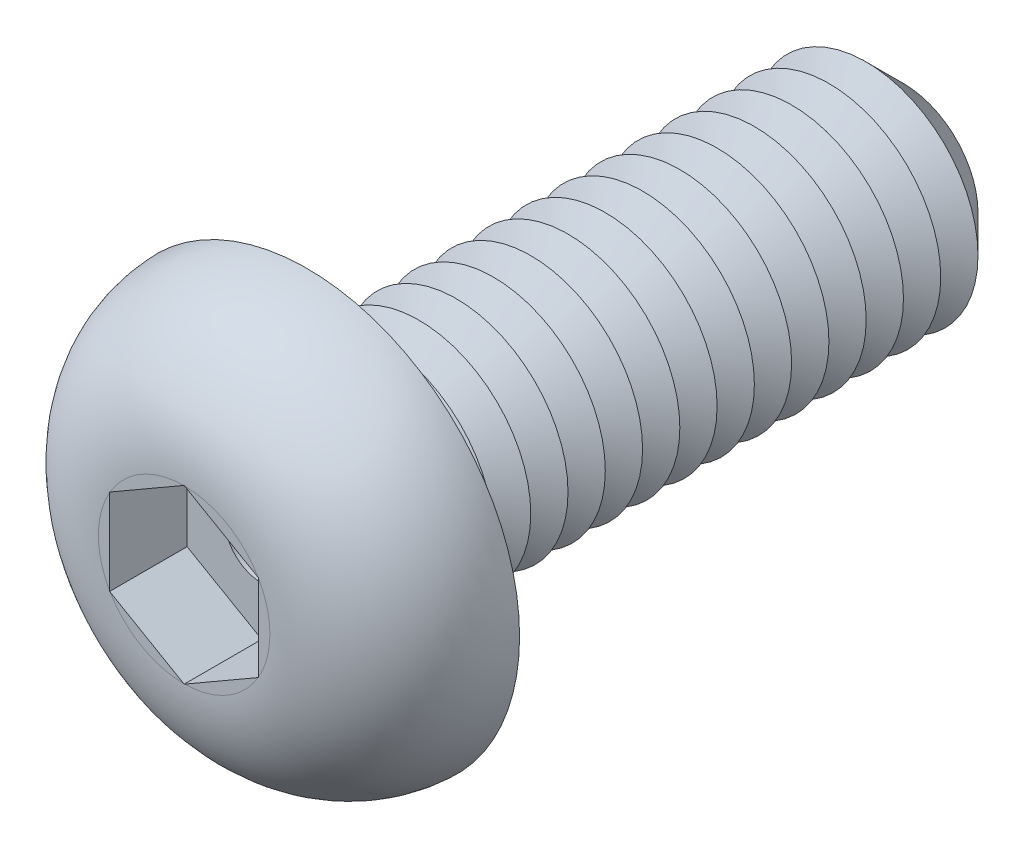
ISO-10303-21;
HEADER;
FILE_DESCRIPTION(('STEP AP214'),'2;1');
FILE_NAME('part.step','',(''),(''),'','','');
FILE_SCHEMA(('AUTOMOTIVE_DESIGN { 1 0 10303 214 1 1 1 1 }'));
ENDSEC;
DATA;
#1=APPLICATION_CONTEXT('core data for automotive mechanical design processes');
#2=APPLICATION_PROTOCOL_DEFINITION('international standard','automotive_design',2000,#1);
#3=PRODUCT_CONTEXT('',#1,'mechanical');
#4=PRODUCT('Part','Part','',(#3));
#5=PRODUCT_RELATED_PRODUCT_CATEGORY('part','',(#4));
#6=PRODUCT_DEFINITION_FORMATION('','',#4);
#7=PRODUCT_DEFINITION_CONTEXT('part definition',#1,'design');
#8=PRODUCT_DEFINITION('design','',#6,#7);
#9=PRODUCT_DEFINITION_SHAPE('','',#8);
#10=(LENGTH_UNIT() NAMED_UNIT(*) SI_UNIT(.MILLI.,.METRE.));
#11=(NAMED_UNIT(*) PLANE_ANGLE_UNIT() SI_UNIT($,.RADIAN.));
#12=(NAMED_UNIT(*) SI_UNIT($,.STERADIAN.) SOLID_ANGLE_UNIT());
#13=UNCERTAINTY_MEASURE_WITH_UNIT(LENGTH_MEASURE(1.E-05),#10,'distance_accuracy_value','');
#14=(GEOMETRIC_REPRESENTATION_CONTEXT(3) GLOBAL_UNCERTAINTY_ASSIGNED_CONTEXT((#13)) GLOBAL_UNIT_ASSIGNED_CONTEXT((#10,
#11,#12)) REPRESENTATION_CONTEXT('',''));
#15=CARTESIAN_POINT('',(0.,0.,0.));
#16=DIRECTION('',(0.,0.,1.));
#17=DIRECTION('',(1.,0.,0.));
#18=AXIS2_PLACEMENT_3D('',#15,#16,#17);
#19=CARTESIAN_POINT('',(0.,0.,-8.));
#20=DIRECTION('',(0.,0.,1.));
#21=DIRECTION('',(1.,0.,0.));
#22=AXIS2_PLACEMENT_3D('',#19,#20,#21);
#23=CYLINDRICAL_SURFACE('',#22,1.5);
#24=CARTESIAN_POINT('',(0.,0.,-0.25));
#25=DIRECTION('',(0.,0.,1.));
#26=DIRECTION('',(1.,0.,0.));
#27=AXIS2_PLACEMENT_3D('',#24,#25,#26);
#28=CIRCLE('',#27,1.5);
#29=CARTESIAN_POINT('',(1.5,0.,-0.25));
#30=VERTEX_POINT('',#29);
#31=EDGE_CURVE('E48',#30,#30,#28,.F.);
#32=ORIENTED_EDGE('',*,*,#31,.T.);
#33=EDGE_LOOP('',(#32));
#34=FACE_BOUND('',#33,.T.);
#35=CARTESIAN_POINT('',(0.,0.,-0.5));
#36=DIRECTION('',(0.,0.,1.));
#37=DIRECTION('',(1.,0.,0.));
#38=AXIS2_PLACEMENT_3D('',#35,#36,#37);
#39=CIRCLE('',#38,1.5);
#40=CARTESIAN_POINT('',(1.5,0.,-0.5));
#41=VERTEX_POINT('',#40);
#42=EDGE_CURVE('E161',#41,#41,#39,.T.);
#43=ORIENTED_EDGE('',*,*,#42,.T.);
#44=EDGE_LOOP('',(#43));
#45=FACE_BOUND('',#44,.T.);
#46=ADVANCED_FACE('F39',(#34,#45),#23,.T.);
#47=CARTESIAN_POINT('',(0.,0.,1.65));
#48=DIRECTION('',(0.,0.,-1.));
#49=DIRECTION('',(-1.,0.,0.));
#50=AXIS2_PLACEMENT_3D('',#47,#48,#49);
#51=PLANE('',#50);
#52=CARTESIAN_POINT('',(0.,0.,1.65));
#53=DIRECTION('',(0.,0.,1.));
#54=DIRECTION('',(1.,0.,0.));
#55=AXIS2_PLACEMENT_3D('',#52,#53,#54);
#56=CIRCLE('',#55,1.15073545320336);
#57=CARTESIAN_POINT('',(0.993096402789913,0.581336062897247,1.65));
#58=VERTEX_POINT('',#57);
#59=CARTESIAN_POINT('',(0.00690359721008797,1.15071474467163,1.65));
#60=VERTEX_POINT('',#59);
#61=EDGE_CURVE('E220',#58,#60,#56,.T.);
#62=ORIENTED_EDGE('',*,*,#61,.T.);
#63=DIRECTION('',(-0.866025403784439,0.5,0.));
#64=VECTOR('',#63,1.);
#65=CARTESIAN_POINT('',(1.,0.577350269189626,1.65));
#66=LINE('',#65,#64);
#67=EDGE_CURVE('E178',#58,#60,#66,.T.);
#68=ORIENTED_EDGE('',*,*,#67,.F.);
#69=EDGE_LOOP('',(#62,#68));
#70=FACE_BOUND('',#69,.T.);
#71=ADVANCED_FACE('F257',(#70),#51,.F.);
#72=CARTESIAN_POINT('',(1.,-0.569378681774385,1.65));
#73=VERTEX_POINT('',#72);
#74=CARTESIAN_POINT('',(1.,0.569378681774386,1.65));
#75=VERTEX_POINT('',#74);
#76=EDGE_CURVE('E215',#73,#75,#56,.T.);
#77=ORIENTED_EDGE('',*,*,#76,.T.);
#78=DIRECTION('',(0.,1.,0.));
#79=VECTOR('',#78,1.);
#80=CARTESIAN_POINT('',(1.,-0.577350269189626,1.65));
#81=LINE('',#80,#79);
#82=EDGE_CURVE('E63',#73,#75,#81,.T.);
#83=ORIENTED_EDGE('',*,*,#82,.F.);
#84=EDGE_LOOP('',(#77,#83));
#85=FACE_BOUND('',#84,.T.);
#86=ADVANCED_FACE('F263',(#85),#51,.F.);
#87=CARTESIAN_POINT('',(0.00690359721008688,-1.15071474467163,1.65));
#88=VERTEX_POINT('',#87);
#89=CARTESIAN_POINT('',(0.993096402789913,-0.581336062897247,1.65));
#90=VERTEX_POINT('',#89);
#91=EDGE_CURVE('E219',#88,#90,#56,.T.);
#92=ORIENTED_EDGE('',*,*,#91,.T.);
#93=DIRECTION('',(0.866025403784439,0.5,0.));
#94=VECTOR('',#93,1.);
#95=CARTESIAN_POINT('',(0.,-1.15470053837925,1.65));
#96=LINE('',#95,#94);
#97=EDGE_CURVE('E190',#88,#90,#96,.T.);
#98=ORIENTED_EDGE('',*,*,#97,.F.);
#99=EDGE_LOOP('',(#92,#98));
#100=FACE_BOUND('',#99,.T.);
#101=ADVANCED_FACE('F327',(#100),#51,.F.);
#102=CARTESIAN_POINT('',(-0.993096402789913,-0.581336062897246,1.65));
#103=VERTEX_POINT('',#102);
#104=CARTESIAN_POINT('',(-0.00690359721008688,-1.15071474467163,1.65));
#105=VERTEX_POINT('',#104);
#106=EDGE_CURVE('E336',#103,#105,#56,.T.);
#107=ORIENTED_EDGE('',*,*,#106,.T.);
#108=DIRECTION('',(0.866025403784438,-0.5,0.));
#109=VECTOR('',#108,1.);
#110=CARTESIAN_POINT('',(-1.,-0.577350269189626,1.65));
#111=LINE('',#110,#109);
#112=EDGE_CURVE('E186',#103,#105,#111,.T.);
#113=ORIENTED_EDGE('',*,*,#112,.F.);
#114=EDGE_LOOP('',(#107,#113));
#115=FACE_BOUND('',#114,.T.);
#116=ADVANCED_FACE('F322',(#115),#51,.F.);
#117=CARTESIAN_POINT('',(-1.,0.569378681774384,1.65));
#118=VERTEX_POINT('',#117);
#119=CARTESIAN_POINT('',(-1.,-0.569378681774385,1.65));
#120=VERTEX_POINT('',#119);
#121=EDGE_CURVE('E332',#118,#120,#56,.T.);
#122=ORIENTED_EDGE('',*,*,#121,.T.);
#123=DIRECTION('',(0.,-1.,0.));
#124=VECTOR('',#123,1.);
#125=CARTESIAN_POINT('',(-1.,0.577350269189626,1.65));
#126=LINE('',#125,#124);
#127=EDGE_CURVE('E182',#118,#120,#126,.T.);
#128=ORIENTED_EDGE('',*,*,#127,.F.);
#129=EDGE_LOOP('',(#122,#128));
#130=FACE_BOUND('',#129,.T.);
#131=ADVANCED_FACE('F313',(#130),#51,.F.);
#132=CARTESIAN_POINT('',(0.,2.85,0.));
#133=DIRECTION('',(0.,0.,1.));
#134=DIRECTION('',(1.,0.,0.));
#135=AXIS2_PLACEMENT_3D('',#132,#133,#134);
#136=PLANE('',#135);
#137=CARTESIAN_POINT('',(0.,0.,0.));
#138=DIRECTION('',(0.,0.,1.));
#139=DIRECTION('',(1.,0.,0.));
#140=AXIS2_PLACEMENT_3D('',#137,#138,#139);
#141=CIRCLE('',#140,1.75);
#142=CARTESIAN_POINT('',(1.75,0.,0.));
#143=VERTEX_POINT('',#142);
#144=EDGE_CURVE('E11',#143,#143,#141,.T.);
#145=ORIENTED_EDGE('',*,*,#144,.T.);
#146=EDGE_LOOP('',(#145));
#147=FACE_BOUND('',#146,.T.);
#148=CARTESIAN_POINT('',(0.,0.,0.));
#149=DIRECTION('',(0.,0.,1.));
#150=DIRECTION('',(1.,0.,0.));
#151=AXIS2_PLACEMENT_3D('',#148,#149,#150);
#152=CIRCLE('',#151,2.85);
#153=CARTESIAN_POINT('',(2.85,0.,0.));
#154=VERTEX_POINT('',#153);
#155=EDGE_CURVE('E197',#154,#154,#152,.T.);
#156=ORIENTED_EDGE('',*,*,#155,.F.);
#157=EDGE_LOOP('',(#156));
#158=FACE_BOUND('',#157,.T.);
#159=ADVANCED_FACE('F310',(#147,#158),#136,.F.);
#160=CARTESIAN_POINT('',(-0.00690359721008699,1.15071474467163,1.65));
#161=VERTEX_POINT('',#160);
#162=CARTESIAN_POINT('',(-0.993096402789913,0.581336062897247,1.65));
#163=VERTEX_POINT('',#162);
#164=EDGE_CURVE('E335',#161,#163,#56,.T.);
#165=ORIENTED_EDGE('',*,*,#164,.T.);
#166=DIRECTION('',(-0.866025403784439,-0.5,0.));
#167=VECTOR('',#166,1.);
#168=CARTESIAN_POINT('',(0.,1.15470053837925,1.65));
#169=LINE('',#168,#167);
#170=EDGE_CURVE('E177',#161,#163,#169,.T.);
#171=ORIENTED_EDGE('',*,*,#170,.F.);
#172=EDGE_LOOP('',(#165,#171));
#173=FACE_BOUND('',#172,.T.);
#174=ADVANCED_FACE('F254',(#173),#51,.F.);
#175=CARTESIAN_POINT('',(0.,0.,-0.0499999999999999));
#176=DIRECTION('',(0.,0.,1.));
#177=DIRECTION('',(1.,0.,0.));
#178=AXIS2_PLACEMENT_3D('',#175,#176,#177);
#179=DEGENERATE_TOROIDAL_SURFACE('',#178,1.15073545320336,1.7,.T.);
#180=ORIENTED_EDGE('',*,*,#61,.F.);
#181=CARTESIAN_POINT('',(1.,0.577350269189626,1.65));
#182=VERTEX_POINT('',#181);
#183=EDGE_CURVE('E174',#182,#58,#66,.T.);
#184=ORIENTED_EDGE('',*,*,#183,.F.);
#185=CARTESIAN_POINT('',(1.,0.,1.64330411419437));
#186=CARTESIAN_POINT('',(1.,-0.0418495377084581,1.64330316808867));
#187=CARTESIAN_POINT('',(1.,-0.0836989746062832,1.64354559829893));
#188=CARTESIAN_POINT('',(1.,-0.167393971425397,1.64442358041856));
#189=CARTESIAN_POINT('',(1.,-0.209239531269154,1.64505913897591));
#190=CARTESIAN_POINT('',(1.,-0.334845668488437,1.64722576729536));
#191=CARTESIAN_POINT('',(1.,-0.418601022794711,1.64901611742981));
#192=CARTESIAN_POINT('',(1.,-0.585792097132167,1.65039211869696));
#193=CARTESIAN_POINT('',(1.,-0.669227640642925,1.64998722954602));
#194=CARTESIAN_POINT('',(1.,-0.83590094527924,1.6440300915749));
#195=CARTESIAN_POINT('',(1.,-0.919138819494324,1.63848280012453));
#196=CARTESIAN_POINT('',(1.,-1.0594136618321,1.62282805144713));
#197=CARTESIAN_POINT('',(1.,-1.11666006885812,1.61463991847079));
#198=CARTESIAN_POINT('',(1.,-1.23041128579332,1.59417176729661));
#199=CARTESIAN_POINT('',(1.,-1.2869163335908,1.58189309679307));
#200=CARTESIAN_POINT('',(1.,-1.39883762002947,1.55283610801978));
#201=CARTESIAN_POINT('',(1.,-1.45425254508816,1.53605268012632));
#202=CARTESIAN_POINT('',(1.,-1.56342884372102,1.49775525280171));
#203=CARTESIAN_POINT('',(1.,-1.61719032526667,1.47624156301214));
#204=CARTESIAN_POINT('',(1.,-1.72305248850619,1.42814032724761));
#205=CARTESIAN_POINT('',(1.,-1.77513121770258,1.40150424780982));
#206=CARTESIAN_POINT('',(1.,-1.87650034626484,1.34331391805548));
#207=CARTESIAN_POINT('',(1.,-1.92578956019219,1.31175759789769));
#208=CARTESIAN_POINT('',(1.,-2.02094663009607,1.24389579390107));
#209=CARTESIAN_POINT('',(1.,-2.06681670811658,1.20759343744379));
#210=CARTESIAN_POINT('',(1.,-2.15460705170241,1.13048515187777));
#211=CARTESIAN_POINT('',(1.,-2.19652613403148,1.08967788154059));
#212=CARTESIAN_POINT('',(1.,-2.30373588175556,0.973753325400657));
#213=CARTESIAN_POINT('',(1.,-2.36480639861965,0.894640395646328));
#214=CARTESIAN_POINT('',(1.,-2.47150299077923,0.726696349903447));
#215=CARTESIAN_POINT('',(1.,-2.51713890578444,0.637871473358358));
#216=CARTESIAN_POINT('',(1.,-2.58857066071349,0.46005750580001));
#217=CARTESIAN_POINT('',(1.,-2.61556805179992,0.371550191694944));
#218=CARTESIAN_POINT('',(1.,-2.65390085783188,0.191213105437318));
#219=CARTESIAN_POINT('',(1.,-2.66523955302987,0.0993840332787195));
#220=CARTESIAN_POINT('',(1.,-2.67179092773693,-0.0825708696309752));
#221=CARTESIAN_POINT('',(1.,-2.66739421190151,-0.17268289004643));
#222=CARTESIAN_POINT('',(1.,-2.64348567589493,-0.350883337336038));
#223=CARTESIAN_POINT('',(1.,-2.62397312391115,-0.438971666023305));
#224=CARTESIAN_POINT('',(1.,-2.57054048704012,-0.610404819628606));
#225=CARTESIAN_POINT('',(1.,-2.53665793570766,-0.693761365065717));
#226=CARTESIAN_POINT('',(1.,-2.45559893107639,-0.85368978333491));
#227=CARTESIAN_POINT('',(1.,-2.40842683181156,-0.930263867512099));
#228=CARTESIAN_POINT('',(1.,-2.30144802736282,-1.07583692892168));
#229=CARTESIAN_POINT('',(1.,-2.24145688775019,-1.14470015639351));
#230=CARTESIAN_POINT('',(1.,-2.11112251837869,-1.27193159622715));
#231=CARTESIAN_POINT('',(1.,-2.04076746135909,-1.33028764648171));
#232=CARTESIAN_POINT('',(1.,-1.88862864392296,-1.43765509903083));
#233=CARTESIAN_POINT('',(1.,-1.80648025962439,-1.48614793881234));
#234=CARTESIAN_POINT('',(1.,-1.63600727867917,-1.56989445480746));
#235=CARTESIAN_POINT('',(1.,-1.54769931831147,-1.60518226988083));
#236=CARTESIAN_POINT('',(1.,-1.39091080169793,-1.65552596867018));
#237=CARTESIAN_POINT('',(1.,-1.32332513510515,-1.67346211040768));
#238=CARTESIAN_POINT('',(1.,-1.18678249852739,-1.70305339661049));
#239=CARTESIAN_POINT('',(1.,-1.11782507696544,-1.71470643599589));
#240=CARTESIAN_POINT('',(1.,-0.978842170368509,-1.73262758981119));
#241=CARTESIAN_POINT('',(1.,-0.908812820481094,-1.73886428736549));
#242=CARTESIAN_POINT('',(1.,-0.768519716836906,-1.74708473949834));
#243=CARTESIAN_POINT('',(1.,-0.698255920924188,-1.74906768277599));
#244=CARTESIAN_POINT('',(1.,-0.527772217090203,-1.75068316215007));
#245=CARTESIAN_POINT('',(1.,-0.427552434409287,-1.74895318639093));
#246=CARTESIAN_POINT('',(1.,-0.27725595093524,-1.74623781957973));
#247=CARTESIAN_POINT('',(1.,-0.227169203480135,-1.74531275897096));
#248=CARTESIAN_POINT('',(1.,-0.126990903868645,-1.74392135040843));
#249=CARTESIAN_POINT('',(1.,-0.0768993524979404,-1.74345496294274));
#250=CARTESIAN_POINT('',(1.,0.02329543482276,-1.7432171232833));
#251=CARTESIAN_POINT('',(1.,0.073398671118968,-1.74344580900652));
#252=CARTESIAN_POINT('',(1.,0.173601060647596,-1.74448066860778));
#253=CARTESIAN_POINT('',(1.,0.223700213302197,-1.74528688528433));
#254=CARTESIAN_POINT('',(1.,0.374032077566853,-1.74796102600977));
#255=CARTESIAN_POINT('',(1.,0.474263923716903,-1.7500840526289));
#256=CARTESIAN_POINT('',(1.,0.646038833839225,-1.74993675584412));
#257=CARTESIAN_POINT('',(1.,0.717572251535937,-1.74875105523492));
#258=CARTESIAN_POINT('',(1.,0.860467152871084,-1.74232930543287));
#259=CARTESIAN_POINT('',(0.999999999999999,0.931828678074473,-1.73709436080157));
#260=CARTESIAN_POINT('',(0.999999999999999,1.07356885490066,-1.72122033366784));
#261=CARTESIAN_POINT('',(0.999999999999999,1.14395079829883,-1.71061248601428));
#262=CARTESIAN_POINT('',(0.999999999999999,1.28345101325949,-1.6830362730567));
#263=CARTESIAN_POINT('',(0.999999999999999,1.35256960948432,-1.66606956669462));
#264=CARTESIAN_POINT('',(0.999999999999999,1.51915230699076,-1.61597650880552));
#265=CARTESIAN_POINT('',(0.999999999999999,1.61551282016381,-1.5790180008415));
#266=CARTESIAN_POINT('',(0.999999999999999,1.80117858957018,-1.48957694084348));
#267=CARTESIAN_POINT('',(0.999999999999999,1.89046083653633,-1.43704619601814));
#268=CARTESIAN_POINT('',(0.999999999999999,2.05877104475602,-1.31682583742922));
#269=CARTESIAN_POINT('',(0.999999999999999,2.13775712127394,-1.24907718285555));
#270=CARTESIAN_POINT('',(0.999999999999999,2.28184060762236,-1.10027015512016));
#271=CARTESIAN_POINT('',(0.999999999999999,2.34695771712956,-1.01923095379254));
#272=CARTESIAN_POINT('',(0.999999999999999,2.45608578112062,-0.853423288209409));
#273=CARTESIAN_POINT('',(0.999999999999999,2.5013878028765,-0.769502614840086));
#274=CARTESIAN_POINT('',(0.999999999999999,2.5765359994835,-0.594973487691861));
#275=CARTESIAN_POINT('',(0.999999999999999,2.60638146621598,-0.504364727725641));
#276=CARTESIAN_POINT('',(0.999999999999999,2.64857466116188,-0.323348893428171));
#277=CARTESIAN_POINT('',(0.999999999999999,2.66163020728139,-0.2331061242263));
#278=CARTESIAN_POINT('',(0.999999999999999,2.67217366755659,-0.0517287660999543));
#279=CARTESIAN_POINT('',(0.999999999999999,2.66966509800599,0.0394056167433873));
#280=CARTESIAN_POINT('',(0.999999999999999,2.64931179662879,0.218675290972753));
#281=CARTESIAN_POINT('',(0.999999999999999,2.63167707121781,0.306834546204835));
#282=CARTESIAN_POINT('',(0.999999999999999,2.58192713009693,0.478965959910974));
#283=CARTESIAN_POINT('',(0.999999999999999,2.54981137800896,0.562937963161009));
#284=CARTESIAN_POINT('',(0.999999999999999,2.47193161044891,0.724823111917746));
#285=CARTESIAN_POINT('',(0.999999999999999,2.42609746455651,0.802702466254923));
#286=CARTESIAN_POINT('',(0.999999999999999,2.32231485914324,0.949889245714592));
#287=CARTESIAN_POINT('',(0.999999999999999,2.26436747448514,1.01919743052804));
#288=CARTESIAN_POINT('',(0.999999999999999,2.13654618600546,1.14929270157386));
#289=CARTESIAN_POINT('',(0.999999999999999,2.0664051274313,1.20981647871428));
#290=CARTESIAN_POINT('',(0.999999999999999,1.9173872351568,1.31904487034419));
#291=CARTESIAN_POINT('',(0.999999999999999,1.83850453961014,1.36774148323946));
#292=CARTESIAN_POINT('',(0.999999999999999,1.71289874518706,1.4328215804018));
#293=CARTESIAN_POINT('',(0.999999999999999,1.66841297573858,1.45365843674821));
#294=CARTESIAN_POINT('',(0.999999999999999,1.57796501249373,1.49187589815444));
#295=CARTESIAN_POINT('',(0.999999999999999,1.53200259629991,1.50925597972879));
#296=CARTESIAN_POINT('',(0.999999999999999,1.43903939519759,1.54059227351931));
#297=CARTESIAN_POINT('',(0.999999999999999,1.39204097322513,1.55455554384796));
#298=CARTESIAN_POINT('',(0.999999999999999,1.29722920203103,1.57925913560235));
#299=CARTESIAN_POINT('',(0.999999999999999,1.24941611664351,1.59000048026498));
#300=CARTESIAN_POINT('',(0.999999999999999,1.10320842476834,1.61808076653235));
#301=CARTESIAN_POINT('',(0.999999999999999,1.00389041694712,1.63067408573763));
#302=CARTESIAN_POINT('',(0.999999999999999,0.804462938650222,1.6463207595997));
#303=CARTESIAN_POINT('',(1.,0.704352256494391,1.64935433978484));
#304=CARTESIAN_POINT('',(1.,0.503474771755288,1.65046619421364));
#305=CARTESIAN_POINT('',(0.999999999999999,0.402708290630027,1.64850957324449));
#306=CARTESIAN_POINT('',(1.,0.251622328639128,1.64577086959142));
#307=CARTESIAN_POINT('',(1.,0.201301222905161,1.64489114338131));
#308=CARTESIAN_POINT('',(1.,0.100653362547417,1.64365834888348));
#309=CARTESIAN_POINT('',(1.,0.0503266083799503,1.64330525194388));
#310=CARTESIAN_POINT('',(1.,0.,1.64330411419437));
#311=B_SPLINE_CURVE_WITH_KNOTS('',3,(#185,#186,#187,#188,#189,#190,#191,#192,#193,#194,#195,
#196,#197,#198,#199,#200,#201,#202,#203,#204,#205,#206,#207,#208,#209,#210,#211,#212,#213,#214,
#215,#216,#217,#218,#219,#220,#221,#222,#223,#224,#225,#226,#227,#228,#229,#230,#231,#232,#233,
#234,#235,#236,#237,#238,#239,#240,#241,#242,#243,#244,#245,#246,#247,#248,#249,#250,#251,#252,
#253,#254,#255,#256,#257,#258,#259,#260,#261,#262,#263,#264,#265,#266,#267,#268,#269,#270,#271,
#272,#273,#274,#275,#276,#277,#278,#279,#280,#281,#282,#283,#284,#285,#286,#287,#288,#289,#290,
#291,#292,#293,#294,#295,#296,#297,#298,#299,#300,#301,#302,#303,#304,#305,#306,#307,#308,#309,
#310),.UNSPECIFIED.,.T.,.F.,(4,2,2,2,2,2,2,2,2,2,2,2,2,2,2,2,2,2,2,2,2,2,2,2,2,2,2,2,2,2,2,2,2,
2,2,2,2,2,2,2,2,2,2,2,2,2,2,2,2,2,2,2,2,2,2,2,2,2,2,2,2,2,4),(0.,0.125547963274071,
0.251098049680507,0.502422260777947,0.752664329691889,1.00266541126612,1.17602519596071,
1.34932792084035,1.52282805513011,1.69631683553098,1.87153849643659,2.04683406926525,
2.22201470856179,2.39724764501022,2.69534138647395,2.99324473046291,3.26948200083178,
3.54566139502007,3.81503317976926,4.08441800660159,4.35310350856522,4.62170108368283,
4.89446026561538,5.16753316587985,5.45251589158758,5.73675667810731,5.94622800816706,
6.15576947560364,6.3665183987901,6.57730751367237,6.87796487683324,7.02825425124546,
7.17853067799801,7.32883692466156,7.47915431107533,7.77989491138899,7.99445526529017,
8.20895711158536,8.42222604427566,8.63543937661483,8.94372593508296,9.25297671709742,
9.56344868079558,9.87347666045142,10.1581355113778,10.4428074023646,10.715036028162,
10.9872031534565,11.2556516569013,11.5241101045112,11.7939650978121,12.0637961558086,
12.3405292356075,12.6174490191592,12.7646985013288,12.9119702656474,13.0589351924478,
13.2058533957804,13.5054664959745,13.8056989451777,14.1080365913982,14.2590238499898,
14.410002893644),.UNSPECIFIED.);
#312=EDGE_CURVE('E278',#182,#75,#311,.T.);
#313=ORIENTED_EDGE('',*,*,#312,.T.);
#314=ORIENTED_EDGE('',*,*,#76,.F.);
#315=CARTESIAN_POINT('',(1.,-0.577350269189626,1.65));
#316=VERTEX_POINT('',#315);
#317=EDGE_CURVE('E154',#316,#73,#81,.T.);
#318=ORIENTED_EDGE('',*,*,#317,.F.);
#319=CARTESIAN_POINT('',(1.0002,-0.577234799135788,1.64999510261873));
#320=CARTESIAN_POINT('',(0.958507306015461,-0.601306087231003,1.65004608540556));
#321=CARTESIAN_POINT('',(0.916820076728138,-0.625374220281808,1.64959104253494));
#322=CARTESIAN_POINT('',(0.83344664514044,-0.673509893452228,1.64822305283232));
#323=CARTESIAN_POINT('',(0.791760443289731,-0.697577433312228,1.6473100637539));
#324=CARTESIAN_POINT('',(0.708395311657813,-0.745708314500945,1.64558069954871));
#325=CARTESIAN_POINT('',(0.666716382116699,-0.769771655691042,1.64476430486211));
#326=CARTESIAN_POINT('',(0.58335598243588,-0.817899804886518,1.64362601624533));
#327=CARTESIAN_POINT('',(0.541674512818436,-0.841964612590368,1.64330408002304));
#328=CARTESIAN_POINT('',(0.45831273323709,-0.890093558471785,1.64330414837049));
#329=CARTESIAN_POINT('',(0.416632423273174,-0.914157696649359,1.64362613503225));
#330=CARTESIAN_POINT('',(0.333274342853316,-0.962284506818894,1.64476447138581));
#331=CARTESIAN_POINT('',(0.291596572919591,-0.986347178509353,1.64558086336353));
#332=CARTESIAN_POINT('',(0.208233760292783,-1.03447672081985,1.64731018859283));
#333=CARTESIAN_POINT('',(0.166548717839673,-1.05854359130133,1.64822314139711));
#334=CARTESIAN_POINT('',(0.0831776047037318,-1.106677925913,1.64959106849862));
#335=CARTESIAN_POINT('',(0.0414915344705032,-1.13074538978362,1.65004608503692));
#336=CARTESIAN_POINT('',(-0.00020000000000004,-1.15481600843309,1.64999510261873));
#337=B_SPLINE_CURVE_WITH_KNOTS('',3,(#319,#320,#321,#322,#323,#324,#325,#326,#327,#328,#329,
#330,#331,#332,#333,#334,#335,#336),.UNSPECIFIED.,.F.,.F.,(4,2,2,2,2,2,2,2,4),(0.,
0.144416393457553,0.288846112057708,0.433246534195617,0.577634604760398,0.722018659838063,
0.866415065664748,1.01084076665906,1.15525314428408),.UNSPECIFIED.);
#338=EDGE_CURVE('E285',#316,#90,#337,.T.);
#339=ORIENTED_EDGE('',*,*,#338,.T.);
#340=ORIENTED_EDGE('',*,*,#91,.F.);
#341=CARTESIAN_POINT('',(0.,-1.15470053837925,1.65));
#342=VERTEX_POINT('',#341);
#343=EDGE_CURVE('E191',#342,#88,#96,.T.);
#344=ORIENTED_EDGE('',*,*,#343,.F.);
#345=CARTESIAN_POINT('',(0.000199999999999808,-1.15481600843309,1.64999510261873));
#346=CARTESIAN_POINT('',(-0.0414926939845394,-1.13074472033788,1.65004608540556));
#347=CARTESIAN_POINT('',(-0.0831799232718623,-1.10667658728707,1.64959104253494));
#348=CARTESIAN_POINT('',(-0.166553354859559,-1.05854091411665,1.64822305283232));
#349=CARTESIAN_POINT('',(-0.208239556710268,-1.03447337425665,1.6473100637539));
#350=CARTESIAN_POINT('',(-0.291604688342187,-0.986342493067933,1.64558069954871));
#351=CARTESIAN_POINT('',(-0.333283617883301,-0.962279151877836,1.64476430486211));
#352=CARTESIAN_POINT('',(-0.41664401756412,-0.91415100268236,1.64362601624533));
#353=CARTESIAN_POINT('',(-0.458325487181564,-0.89008619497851,1.64330408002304));
#354=CARTESIAN_POINT('',(-0.54168726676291,-0.841957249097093,1.64330414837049));
#355=CARTESIAN_POINT('',(-0.583367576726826,-0.817893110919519,1.64362613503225));
#356=CARTESIAN_POINT('',(-0.666725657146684,-0.769766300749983,1.64476447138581));
#357=CARTESIAN_POINT('',(-0.708403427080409,-0.745703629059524,1.64558086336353));
#358=CARTESIAN_POINT('',(-0.791766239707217,-0.697574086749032,1.64731018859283));
#359=CARTESIAN_POINT('',(-0.833451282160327,-0.673507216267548,1.64822314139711));
#360=CARTESIAN_POINT('',(-0.916822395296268,-0.625372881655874,1.64959106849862));
#361=CARTESIAN_POINT('',(-0.958508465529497,-0.601305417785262,1.65004608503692));
#362=CARTESIAN_POINT('',(-1.0002,-0.577234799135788,1.64999510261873));
#363=B_SPLINE_CURVE_WITH_KNOTS('',3,(#345,#346,#347,#348,#349,#350,#351,#352,#353,#354,#355,
#356,#357,#358,#359,#360,#361,#362),.UNSPECIFIED.,.F.,.F.,(4,2,2,2,2,2,2,2,4),(0.,
0.144416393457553,0.288846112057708,0.433246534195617,0.577634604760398,0.722018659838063,
0.866415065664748,1.01084076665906,1.15525314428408),.UNSPECIFIED.);
#364=EDGE_CURVE('E358',#342,#105,#363,.T.);
#365=ORIENTED_EDGE('',*,*,#364,.T.);
#366=ORIENTED_EDGE('',*,*,#106,.F.);
#367=CARTESIAN_POINT('',(-1.,-0.577350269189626,1.65));
#368=VERTEX_POINT('',#367);
#369=EDGE_CURVE('E187',#368,#103,#111,.T.);
#370=ORIENTED_EDGE('',*,*,#369,.F.);
#371=CARTESIAN_POINT('',(-1.,0.,1.64330411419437));
#372=CARTESIAN_POINT('',(-1.,0.0418495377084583,1.64330316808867));
#373=CARTESIAN_POINT('',(-1.,0.0836989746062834,1.64354559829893));
#374=CARTESIAN_POINT('',(-1.,0.167393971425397,1.64442358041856));
#375=CARTESIAN_POINT('',(-1.,0.209239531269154,1.64505913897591));
#376=CARTESIAN_POINT('',(-1.,0.334845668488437,1.64722576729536));
#377=CARTESIAN_POINT('',(-1.,0.418601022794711,1.64901611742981));
#378=CARTESIAN_POINT('',(-1.,0.585792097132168,1.65039211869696));
#379=CARTESIAN_POINT('',(-1.,0.669227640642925,1.64998722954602));
#380=CARTESIAN_POINT('',(-1.,0.835900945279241,1.6440300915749));
#381=CARTESIAN_POINT('',(-1.,0.919138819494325,1.63848280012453));
#382=CARTESIAN_POINT('',(-1.,1.0594136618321,1.62282805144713));
#383=CARTESIAN_POINT('',(-1.,1.11666006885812,1.61463991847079));
#384=CARTESIAN_POINT('',(-1.,1.23041128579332,1.59417176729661));
#385=CARTESIAN_POINT('',(-1.,1.2869163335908,1.58189309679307));
#386=CARTESIAN_POINT('',(-1.,1.39883762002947,1.55283610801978));
#387=CARTESIAN_POINT('',(-1.,1.45425254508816,1.53605268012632));
#388=CARTESIAN_POINT('',(-1.,1.56342884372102,1.49775525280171));
#389=CARTESIAN_POINT('',(-1.,1.61719032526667,1.47624156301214));
#390=CARTESIAN_POINT('',(-1.,1.72305248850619,1.42814032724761));
#391=CARTESIAN_POINT('',(-1.,1.77513121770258,1.40150424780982));
#392=CARTESIAN_POINT('',(-1.,1.87650034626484,1.34331391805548));
#393=CARTESIAN_POINT('',(-1.,1.92578956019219,1.31175759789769));
#394=CARTESIAN_POINT('',(-1.,2.02094663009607,1.24389579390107));
#395=CARTESIAN_POINT('',(-1.,2.06681670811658,1.20759343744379));
#396=CARTESIAN_POINT('',(-1.,2.15460705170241,1.13048515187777));
#397=CARTESIAN_POINT('',(-1.,2.19652613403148,1.08967788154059));
#398=CARTESIAN_POINT('',(-1.,2.30373588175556,0.973753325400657));
#399=CARTESIAN_POINT('',(-1.,2.36480639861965,0.894640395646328));
#400=CARTESIAN_POINT('',(-1.,2.47150299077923,0.726696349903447));
#401=CARTESIAN_POINT('',(-1.,2.51713890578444,0.637871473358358));
#402=CARTESIAN_POINT('',(-1.,2.58857066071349,0.46005750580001));
#403=CARTESIAN_POINT('',(-1.,2.61556805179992,0.371550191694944));
#404=CARTESIAN_POINT('',(-1.,2.65390085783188,0.191213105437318));
#405=CARTESIAN_POINT('',(-1.,2.66523955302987,0.0993840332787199));
#406=CARTESIAN_POINT('',(-1.,2.67179092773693,-0.0825708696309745));
#407=CARTESIAN_POINT('',(-1.,2.66739421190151,-0.17268289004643));
#408=CARTESIAN_POINT('',(-1.,2.64348567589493,-0.350883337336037));
#409=CARTESIAN_POINT('',(-1.,2.62397312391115,-0.438971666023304));
#410=CARTESIAN_POINT('',(-1.,2.57054048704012,-0.610404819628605));
#411=CARTESIAN_POINT('',(-1.,2.53665793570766,-0.693761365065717));
#412=CARTESIAN_POINT('',(-1.,2.45559893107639,-0.853689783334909));
#413=CARTESIAN_POINT('',(-1.,2.40842683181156,-0.930263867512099));
#414=CARTESIAN_POINT('',(-1.,2.30144802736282,-1.07583692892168));
#415=CARTESIAN_POINT('',(-1.,2.24145688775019,-1.14470015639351));
#416=CARTESIAN_POINT('',(-1.,2.11112251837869,-1.27193159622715));
#417=CARTESIAN_POINT('',(-1.,2.04076746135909,-1.33028764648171));
#418=CARTESIAN_POINT('',(-1.,1.88862864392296,-1.43765509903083));
#419=CARTESIAN_POINT('',(-1.,1.80648025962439,-1.48614793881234));
#420=CARTESIAN_POINT('',(-1.,1.63600727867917,-1.56989445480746));
#421=CARTESIAN_POINT('',(-1.,1.54769931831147,-1.60518226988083));
#422=CARTESIAN_POINT('',(-1.,1.39091080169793,-1.65552596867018));
#423=CARTESIAN_POINT('',(-1.,1.32332513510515,-1.67346211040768));
#424=CARTESIAN_POINT('',(-1.,1.18678249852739,-1.70305339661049));
#425=CARTESIAN_POINT('',(-1.,1.11782507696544,-1.71470643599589));
#426=CARTESIAN_POINT('',(-1.,0.97884217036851,-1.73262758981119));
#427=CARTESIAN_POINT('',(-1.,0.908812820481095,-1.73886428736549));
#428=CARTESIAN_POINT('',(-1.,0.768519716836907,-1.74708473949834));
#429=CARTESIAN_POINT('',(-1.,0.698255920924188,-1.74906768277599));
#430=CARTESIAN_POINT('',(-1.,0.527772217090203,-1.75068316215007));
#431=CARTESIAN_POINT('',(-1.,0.427552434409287,-1.74895318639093));
#432=CARTESIAN_POINT('',(-1.,0.27725595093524,-1.74623781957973));
#433=CARTESIAN_POINT('',(-1.,0.227169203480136,-1.74531275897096));
#434=CARTESIAN_POINT('',(-1.,0.126990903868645,-1.74392135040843));
#435=CARTESIAN_POINT('',(-1.,0.0768993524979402,-1.74345496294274));
#436=CARTESIAN_POINT('',(-1.,-0.0232954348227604,-1.7432171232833));
#437=CARTESIAN_POINT('',(-1.,-0.0733986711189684,-1.74344580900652));
#438=CARTESIAN_POINT('',(-1.,-0.173601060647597,-1.74448066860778));
#439=CARTESIAN_POINT('',(-1.,-0.223700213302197,-1.74528688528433));
#440=CARTESIAN_POINT('',(-1.,-0.374032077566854,-1.74796102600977));
#441=CARTESIAN_POINT('',(-1.,-0.474263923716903,-1.7500840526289));
#442=CARTESIAN_POINT('',(-1.,-0.646038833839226,-1.74993675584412));
#443=CARTESIAN_POINT('',(-1.,-0.717572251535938,-1.74875105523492));
#444=CARTESIAN_POINT('',(-1.,-0.860467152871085,-1.74232930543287));
#445=CARTESIAN_POINT('',(-1.,-0.931828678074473,-1.73709436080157));
#446=CARTESIAN_POINT('',(-1.,-1.07356885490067,-1.72122033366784));
#447=CARTESIAN_POINT('',(-1.,-1.14395079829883,-1.71061248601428));
#448=CARTESIAN_POINT('',(-1.,-1.28345101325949,-1.6830362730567));
#449=CARTESIAN_POINT('',(-1.,-1.35256960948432,-1.66606956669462));
#450=CARTESIAN_POINT('',(-1.,-1.51915230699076,-1.61597650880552));
#451=CARTESIAN_POINT('',(-1.,-1.61551282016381,-1.5790180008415));
#452=CARTESIAN_POINT('',(-1.,-1.80117858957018,-1.48957694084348));
#453=CARTESIAN_POINT('',(-1.,-1.89046083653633,-1.43704619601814));
#454=CARTESIAN_POINT('',(-1.,-2.05877104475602,-1.31682583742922));
#455=CARTESIAN_POINT('',(-0.999999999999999,-2.13775712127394,-1.24907718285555));
#456=CARTESIAN_POINT('',(-0.999999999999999,-2.28184060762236,-1.10027015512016));
#457=CARTESIAN_POINT('',(-0.999999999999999,-2.34695771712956,-1.01923095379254));
#458=CARTESIAN_POINT('',(-0.999999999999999,-2.45608578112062,-0.85342328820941));
#459=CARTESIAN_POINT('',(-0.999999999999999,-2.50138780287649,-0.769502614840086));
#460=CARTESIAN_POINT('',(-0.999999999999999,-2.5765359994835,-0.594973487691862));
#461=CARTESIAN_POINT('',(-0.999999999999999,-2.60638146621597,-0.504364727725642));
#462=CARTESIAN_POINT('',(-0.999999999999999,-2.64857466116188,-0.323348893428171));
#463=CARTESIAN_POINT('',(-0.999999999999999,-2.66163020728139,-0.2331061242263));
#464=CARTESIAN_POINT('',(-0.999999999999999,-2.67217366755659,-0.0517287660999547));
#465=CARTESIAN_POINT('',(-0.999999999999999,-2.66966509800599,0.0394056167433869));
#466=CARTESIAN_POINT('',(-0.999999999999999,-2.64931179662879,0.218675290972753));
#467=CARTESIAN_POINT('',(-0.999999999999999,-2.63167707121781,0.306834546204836));
#468=CARTESIAN_POINT('',(-0.999999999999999,-2.58192713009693,0.478965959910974));
#469=CARTESIAN_POINT('',(-0.999999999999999,-2.54981137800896,0.562937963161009));
#470=CARTESIAN_POINT('',(-0.999999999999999,-2.47193161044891,0.724823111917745));
#471=CARTESIAN_POINT('',(-0.999999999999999,-2.42609746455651,0.802702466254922));
#472=CARTESIAN_POINT('',(-0.999999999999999,-2.32231485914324,0.949889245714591));
#473=CARTESIAN_POINT('',(-0.999999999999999,-2.26436747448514,1.01919743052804));
#474=CARTESIAN_POINT('',(-0.999999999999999,-2.13654618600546,1.14929270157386));
#475=CARTESIAN_POINT('',(-1.,-2.06640512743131,1.20981647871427));
#476=CARTESIAN_POINT('',(-1.,-1.9173872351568,1.31904487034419));
#477=CARTESIAN_POINT('',(-1.,-1.83850453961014,1.36774148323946));
#478=CARTESIAN_POINT('',(-1.,-1.71289874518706,1.4328215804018));
#479=CARTESIAN_POINT('',(-1.,-1.66841297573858,1.45365843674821));
#480=CARTESIAN_POINT('',(-1.,-1.57796501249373,1.49187589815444));
#481=CARTESIAN_POINT('',(-1.,-1.53200259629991,1.50925597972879));
#482=CARTESIAN_POINT('',(-1.,-1.43903939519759,1.54059227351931));
#483=CARTESIAN_POINT('',(-1.,-1.39204097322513,1.55455554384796));
#484=CARTESIAN_POINT('',(-1.,-1.29722920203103,1.57925913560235));
#485=CARTESIAN_POINT('',(-1.,-1.24941611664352,1.59000048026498));
#486=CARTESIAN_POINT('',(-1.,-1.10320842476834,1.61808076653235));
#487=CARTESIAN_POINT('',(-1.,-1.00389041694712,1.63067408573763));
#488=CARTESIAN_POINT('',(-1.,-0.804462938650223,1.6463207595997));
#489=CARTESIAN_POINT('',(-1.,-0.704352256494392,1.64935433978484));
#490=CARTESIAN_POINT('',(-1.,-0.503474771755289,1.65046619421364));
#491=CARTESIAN_POINT('',(-1.,-0.402708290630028,1.64850957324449));
#492=CARTESIAN_POINT('',(-1.,-0.251622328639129,1.64577086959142));
#493=CARTESIAN_POINT('',(-1.,-0.201301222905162,1.64489114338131));
#494=CARTESIAN_POINT('',(-1.,-0.100653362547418,1.64365834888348));
#495=CARTESIAN_POINT('',(-1.,-0.0503266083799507,1.64330525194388));
#496=CARTESIAN_POINT('',(-1.,0.,1.64330411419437));
#497=B_SPLINE_CURVE_WITH_KNOTS('',3,(#371,#372,#373,#374,#375,#376,#377,#378,#379,#380,#381,
#382,#383,#384,#385,#386,#387,#388,#389,#390,#391,#392,#393,#394,#395,#396,#397,#398,#399,#400,
#401,#402,#403,#404,#405,#406,#407,#408,#409,#410,#411,#412,#413,#414,#415,#416,#417,#418,#419,
#420,#421,#422,#423,#424,#425,#426,#427,#428,#429,#430,#431,#432,#433,#434,#435,#436,#437,#438,
#439,#440,#441,#442,#443,#444,#445,#446,#447,#448,#449,#450,#451,#452,#453,#454,#455,#456,#457,
#458,#459,#460,#461,#462,#463,#464,#465,#466,#467,#468,#469,#470,#471,#472,#473,#474,#475,#476,
#477,#478,#479,#480,#481,#482,#483,#484,#485,#486,#487,#488,#489,#490,#491,#492,#493,#494,#495,
#496),.UNSPECIFIED.,.T.,.F.,(4,2,2,2,2,2,2,2,2,2,2,2,2,2,2,2,2,2,2,2,2,2,2,2,2,2,2,2,2,2,2,2,2,
2,2,2,2,2,2,2,2,2,2,2,2,2,2,2,2,2,2,2,2,2,2,2,2,2,2,2,2,2,4),(0.,0.125547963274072,
0.251098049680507,0.502422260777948,0.752664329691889,1.00266541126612,1.17602519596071,
1.34932792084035,1.52282805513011,1.69631683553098,1.87153849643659,2.04683406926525,
2.22201470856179,2.39724764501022,2.69534138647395,2.99324473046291,3.26948200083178,
3.54566139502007,3.81503317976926,4.08441800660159,4.35310350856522,4.62170108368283,
4.89446026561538,5.16753316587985,5.45251589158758,5.73675667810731,5.94622800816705,
6.15576947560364,6.3665183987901,6.57730751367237,6.87796487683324,7.02825425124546,
7.17853067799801,7.32883692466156,7.47915431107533,7.77989491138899,7.99445526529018,
8.20895711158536,8.42222604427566,8.63543937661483,8.94372593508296,9.25297671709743,
9.56344868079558,9.87347666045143,10.1581355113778,10.4428074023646,10.715036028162,
10.9872031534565,11.2556516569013,11.5241101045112,11.7939650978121,12.0637961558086,
12.3405292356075,12.6174490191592,12.7646985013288,12.9119702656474,13.0589351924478,
13.2058533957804,13.5054664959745,13.8056989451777,14.1080365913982,14.2590238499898,
14.410002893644),.UNSPECIFIED.);
#498=EDGE_CURVE('E230',#368,#120,#497,.T.);
#499=ORIENTED_EDGE('',*,*,#498,.T.);
#500=ORIENTED_EDGE('',*,*,#121,.F.);
#501=CARTESIAN_POINT('',(-1.,0.577350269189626,1.65));
#502=VERTEX_POINT('',#501);
#503=EDGE_CURVE('E183',#502,#118,#126,.T.);
#504=ORIENTED_EDGE('',*,*,#503,.F.);
#505=CARTESIAN_POINT('',(-1.0002,0.577234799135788,1.64999510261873));
#506=CARTESIAN_POINT('',(-0.958507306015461,0.601306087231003,1.65004608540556));
#507=CARTESIAN_POINT('',(-0.916820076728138,0.625374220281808,1.64959104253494));
#508=CARTESIAN_POINT('',(-0.833446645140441,0.673509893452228,1.64822305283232));
#509=CARTESIAN_POINT('',(-0.791760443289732,0.697577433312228,1.6473100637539));
#510=CARTESIAN_POINT('',(-0.708395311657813,0.745708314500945,1.64558069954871));
#511=CARTESIAN_POINT('',(-0.666716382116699,0.769771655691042,1.64476430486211));
#512=CARTESIAN_POINT('',(-0.58335598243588,0.817899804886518,1.64362601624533));
#513=CARTESIAN_POINT('',(-0.541674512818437,0.841964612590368,1.64330408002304));
#514=CARTESIAN_POINT('',(-0.45831273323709,0.890093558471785,1.64330414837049));
#515=CARTESIAN_POINT('',(-0.416632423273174,0.914157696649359,1.64362613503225));
#516=CARTESIAN_POINT('',(-0.333274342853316,0.962284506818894,1.64476447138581));
#517=CARTESIAN_POINT('',(-0.291596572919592,0.986347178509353,1.64558086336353));
#518=CARTESIAN_POINT('',(-0.208233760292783,1.03447672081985,1.64731018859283));
#519=CARTESIAN_POINT('',(-0.166548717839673,1.05854359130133,1.64822314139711));
#520=CARTESIAN_POINT('',(-0.0831776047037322,1.106677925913,1.64959106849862));
#521=CARTESIAN_POINT('',(-0.0414915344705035,1.13074538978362,1.65004608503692));
#522=CARTESIAN_POINT('',(0.000199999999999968,1.15481600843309,1.64999510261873));
#523=B_SPLINE_CURVE_WITH_KNOTS('',3,(#505,#506,#507,#508,#509,#510,#511,#512,#513,#514,#515,
#516,#517,#518,#519,#520,#521,#522),.UNSPECIFIED.,.F.,.F.,(4,2,2,2,2,2,2,2,4),(0.,
0.144416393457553,0.288846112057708,0.433246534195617,0.577634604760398,0.722018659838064,
0.866415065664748,1.01084076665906,1.15525314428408),.UNSPECIFIED.);
#524=EDGE_CURVE('E221',#502,#163,#523,.T.);
#525=ORIENTED_EDGE('',*,*,#524,.T.);
#526=ORIENTED_EDGE('',*,*,#164,.F.);
#527=CARTESIAN_POINT('',(-4.670154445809E-09,1.15470053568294,1.64999537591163));
#528=VERTEX_POINT('',#527);
#529=EDGE_CURVE('E179',#528,#161,#169,.T.);
#530=ORIENTED_EDGE('',*,*,#529,.F.);
#531=CARTESIAN_POINT('',(-0.000199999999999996,1.15481600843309,1.64999510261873));
#532=CARTESIAN_POINT('',(0.0414926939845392,1.13074472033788,1.65004608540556));
#533=CARTESIAN_POINT('',(0.0831799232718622,1.10667658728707,1.64959104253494));
#534=CARTESIAN_POINT('',(0.166553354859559,1.05854091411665,1.64822305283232));
#535=CARTESIAN_POINT('',(0.208239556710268,1.03447337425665,1.6473100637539));
#536=CARTESIAN_POINT('',(0.291604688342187,0.986342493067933,1.64558069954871));
#537=CARTESIAN_POINT('',(0.3332836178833,0.962279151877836,1.64476430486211));
#538=CARTESIAN_POINT('',(0.41664401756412,0.91415100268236,1.64362601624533));
#539=CARTESIAN_POINT('',(0.458325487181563,0.89008619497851,1.64330408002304));
#540=CARTESIAN_POINT('',(0.54168726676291,0.841957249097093,1.64330414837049));
#541=CARTESIAN_POINT('',(0.583367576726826,0.817893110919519,1.64362613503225));
#542=CARTESIAN_POINT('',(0.666725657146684,0.769766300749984,1.64476447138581));
#543=CARTESIAN_POINT('',(0.708403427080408,0.745703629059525,1.64558086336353));
#544=CARTESIAN_POINT('',(0.791766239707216,0.697574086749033,1.64731018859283));
#545=CARTESIAN_POINT('',(0.833451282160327,0.673507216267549,1.64822314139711));
#546=CARTESIAN_POINT('',(0.916822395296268,0.625372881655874,1.64959106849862));
#547=CARTESIAN_POINT('',(0.958508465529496,0.601305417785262,1.65004608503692));
#548=CARTESIAN_POINT('',(1.0002,0.577234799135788,1.64999510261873));
#549=B_SPLINE_CURVE_WITH_KNOTS('',3,(#531,#532,#533,#534,#535,#536,#537,#538,#539,#540,#541,
#542,#543,#544,#545,#546,#547,#548),.UNSPECIFIED.,.F.,.F.,(4,2,2,2,2,2,2,2,4),(0.,
0.144416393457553,0.288846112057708,0.433246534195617,0.577634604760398,0.722018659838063,
0.866415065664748,1.01084076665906,1.15525314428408),.UNSPECIFIED.);
#550=EDGE_CURVE('E134',#528,#60,#549,.T.);
#551=ORIENTED_EDGE('',*,*,#550,.T.);
#552=EDGE_LOOP('',(#180,#184,#313,#314,#318,#339,#340,#344,#365,#366,#370,#499,#500,#504,#525,
#526,#530,#551));
#553=FACE_BOUND('',#552,.T.);
#554=ORIENTED_EDGE('',*,*,#155,.T.);
#555=EDGE_LOOP('',(#554));
#556=FACE_BOUND('',#555,.T.);
#557=ADVANCED_FACE('F236',(#553,#556),#179,.T.);
#558=CARTESIAN_POINT('',(1.,0.577350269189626,0.61));
#559=DIRECTION('',(0.5,0.866025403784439,0.));
#560=DIRECTION('',(-0.866025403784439,0.5,0.));
#561=AXIS2_PLACEMENT_3D('',#558,#559,#560);
#562=PLANE('',#561);
#563=ORIENTED_EDGE('',*,*,#183,.T.);
#564=ORIENTED_EDGE('',*,*,#67,.T.);
#565=ORIENTED_EDGE('',*,*,#550,.F.);
#566=DIRECTION('',(0.,0.,1.));
#567=VECTOR('',#566,1.);
#568=CARTESIAN_POINT('',(0.,1.15470053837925,0.61));
#569=LINE('',#568,#567);
#570=CARTESIAN_POINT('',(0.,1.15470053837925,0.61));
#571=VERTEX_POINT('',#570);
#572=EDGE_CURVE('E55',#571,#528,#569,.T.);
#573=ORIENTED_EDGE('',*,*,#572,.F.);
#574=DIRECTION('',(-0.866025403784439,0.5,0.));
#575=VECTOR('',#574,1.);
#576=CARTESIAN_POINT('',(1.,0.577350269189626,0.61));
#577=LINE('',#576,#575);
#578=CARTESIAN_POINT('',(1.,0.577350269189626,0.61));
#579=VERTEX_POINT('',#578);
#580=EDGE_CURVE('E131',#579,#571,#577,.T.);
#581=ORIENTED_EDGE('',*,*,#580,.F.);
#582=DIRECTION('',(0.,0.,1.));
#583=VECTOR('',#582,1.);
#584=CARTESIAN_POINT('',(1.,0.577350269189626,0.61));
#585=LINE('',#584,#583);
#586=EDGE_CURVE('E194',#579,#182,#585,.T.);
#587=ORIENTED_EDGE('',*,*,#586,.T.);
#588=EDGE_LOOP('',(#563,#564,#565,#573,#581,#587));
#589=FACE_BOUND('',#588,.T.);
#590=ADVANCED_FACE('F128',(#589),#562,.F.);
#591=CARTESIAN_POINT('',(1.,-0.577350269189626,0.61));
#592=DIRECTION('',(1.,0.,0.));
#593=DIRECTION('',(0.,1.,0.));
#594=AXIS2_PLACEMENT_3D('',#591,#592,#593);
#595=PLANE('',#594);
#596=ORIENTED_EDGE('',*,*,#317,.T.);
#597=ORIENTED_EDGE('',*,*,#82,.T.);
#598=ORIENTED_EDGE('',*,*,#312,.F.);
#599=ORIENTED_EDGE('',*,*,#586,.F.);
#600=DIRECTION('',(0.,1.,0.));
#601=VECTOR('',#600,1.);
#602=CARTESIAN_POINT('',(1.,-0.577350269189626,0.61));
#603=LINE('',#602,#601);
#604=CARTESIAN_POINT('',(1.,-0.577350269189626,0.61));
#605=VERTEX_POINT('',#604);
#606=EDGE_CURVE('E138',#605,#579,#603,.T.);
#607=ORIENTED_EDGE('',*,*,#606,.F.);
#608=DIRECTION('',(0.,0.,1.));
#609=VECTOR('',#608,1.);
#610=CARTESIAN_POINT('',(1.,-0.577350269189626,0.61));
#611=LINE('',#610,#609);
#612=EDGE_CURVE('E198',#605,#316,#611,.T.);
#613=ORIENTED_EDGE('',*,*,#612,.T.);
#614=EDGE_LOOP('',(#596,#597,#598,#599,#607,#613));
#615=FACE_BOUND('',#614,.T.);
#616=ADVANCED_FACE('F247',(#615),#595,.F.);
#617=CARTESIAN_POINT('',(0.,-1.15470053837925,0.61));
#618=DIRECTION('',(0.5,-0.866025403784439,0.));
#619=DIRECTION('',(0.866025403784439,0.5,0.));
#620=AXIS2_PLACEMENT_3D('',#617,#618,#619);
#621=PLANE('',#620);
#622=ORIENTED_EDGE('',*,*,#343,.T.);
#623=ORIENTED_EDGE('',*,*,#97,.T.);
#624=ORIENTED_EDGE('',*,*,#338,.F.);
#625=ORIENTED_EDGE('',*,*,#612,.F.);
#626=DIRECTION('',(0.866025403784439,0.5,0.));
#627=VECTOR('',#626,1.);
#628=CARTESIAN_POINT('',(0.,-1.15470053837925,0.61));
#629=LINE('',#628,#627);
#630=CARTESIAN_POINT('',(0.,-1.15470053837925,0.61));
#631=VERTEX_POINT('',#630);
#632=EDGE_CURVE('E170',#631,#605,#629,.T.);
#633=ORIENTED_EDGE('',*,*,#632,.F.);
#634=DIRECTION('',(0.,0.,1.));
#635=VECTOR('',#634,1.);
#636=CARTESIAN_POINT('',(0.,-1.15470053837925,0.61));
#637=LINE('',#636,#635);
#638=EDGE_CURVE('E202',#631,#342,#637,.T.);
#639=ORIENTED_EDGE('',*,*,#638,.T.);
#640=EDGE_LOOP('',(#622,#623,#624,#625,#633,#639));
#641=FACE_BOUND('',#640,.T.);
#642=ADVANCED_FACE('F252',(#641),#621,.F.);
#643=CARTESIAN_POINT('',(-1.,-0.577350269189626,0.61));
#644=DIRECTION('',(-0.5,-0.866025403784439,0.));
#645=DIRECTION('',(0.866025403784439,-0.5,0.));
#646=AXIS2_PLACEMENT_3D('',#643,#644,#645);
#647=PLANE('',#646);
#648=ORIENTED_EDGE('',*,*,#369,.T.);
#649=ORIENTED_EDGE('',*,*,#112,.T.);
#650=ORIENTED_EDGE('',*,*,#364,.F.);
#651=ORIENTED_EDGE('',*,*,#638,.F.);
#652=DIRECTION('',(0.866025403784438,-0.5,0.));
#653=VECTOR('',#652,1.);
#654=CARTESIAN_POINT('',(-1.,-0.577350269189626,0.61));
#655=LINE('',#654,#653);
#656=CARTESIAN_POINT('',(-1.,-0.577350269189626,0.61));
#657=VERTEX_POINT('',#656);
#658=EDGE_CURVE('E166',#657,#631,#655,.T.);
#659=ORIENTED_EDGE('',*,*,#658,.F.);
#660=DIRECTION('',(0.,0.,1.));
#661=VECTOR('',#660,1.);
#662=CARTESIAN_POINT('',(-1.,-0.577350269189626,0.61));
#663=LINE('',#662,#661);
#664=EDGE_CURVE('E206',#657,#368,#663,.T.);
#665=ORIENTED_EDGE('',*,*,#664,.T.);
#666=EDGE_LOOP('',(#648,#649,#650,#651,#659,#665));
#667=FACE_BOUND('',#666,.T.);
#668=ADVANCED_FACE('F366',(#667),#647,.F.);
#669=CARTESIAN_POINT('',(-1.,0.577350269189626,0.61));
#670=DIRECTION('',(-1.,0.,0.));
#671=DIRECTION('',(0.,-1.,0.));
#672=AXIS2_PLACEMENT_3D('',#669,#670,#671);
#673=PLANE('',#672);
#674=ORIENTED_EDGE('',*,*,#503,.T.);
#675=ORIENTED_EDGE('',*,*,#127,.T.);
#676=ORIENTED_EDGE('',*,*,#498,.F.);
#677=ORIENTED_EDGE('',*,*,#664,.F.);
#678=DIRECTION('',(0.,-1.,0.));
#679=VECTOR('',#678,1.);
#680=CARTESIAN_POINT('',(-1.,0.577350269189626,0.61));
#681=LINE('',#680,#679);
#682=CARTESIAN_POINT('',(-1.,0.577350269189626,0.61));
#683=VERTEX_POINT('',#682);
#684=EDGE_CURVE('E148',#683,#657,#681,.T.);
#685=ORIENTED_EDGE('',*,*,#684,.F.);
#686=DIRECTION('',(0.,0.,1.));
#687=VECTOR('',#686,1.);
#688=CARTESIAN_POINT('',(-1.,0.577350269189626,0.61));
#689=LINE('',#688,#687);
#690=EDGE_CURVE('E137',#683,#502,#689,.T.);
#691=ORIENTED_EDGE('',*,*,#690,.T.);
#692=EDGE_LOOP('',(#674,#675,#676,#677,#685,#691));
#693=FACE_BOUND('',#692,.T.);
#694=ADVANCED_FACE('F242',(#693),#673,.F.);
#695=CARTESIAN_POINT('',(0.,1.15470053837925,0.61));
#696=DIRECTION('',(-0.5,0.866025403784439,0.));
#697=DIRECTION('',(-0.866025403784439,-0.5,0.));
#698=AXIS2_PLACEMENT_3D('',#695,#696,#697);
#699=PLANE('',#698);
#700=ORIENTED_EDGE('',*,*,#529,.T.);
#701=ORIENTED_EDGE('',*,*,#170,.T.);
#702=ORIENTED_EDGE('',*,*,#524,.F.);
#703=ORIENTED_EDGE('',*,*,#690,.F.);
#704=DIRECTION('',(-0.866025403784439,-0.5,0.));
#705=VECTOR('',#704,1.);
#706=CARTESIAN_POINT('',(0.,1.15470053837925,0.61));
#707=LINE('',#706,#705);
#708=EDGE_CURVE('E141',#571,#683,#707,.T.);
#709=ORIENTED_EDGE('',*,*,#708,.F.);
#710=ORIENTED_EDGE('',*,*,#572,.T.);
#711=EDGE_LOOP('',(#700,#701,#702,#703,#709,#710));
#712=FACE_BOUND('',#711,.T.);
#713=ADVANCED_FACE('F142',(#712),#699,.F.);
#714=CARTESIAN_POINT('',(0.,0.,0.61));
#715=DIRECTION('',(0.,0.,1.));
#716=DIRECTION('',(1.,0.,0.));
#717=AXIS2_PLACEMENT_3D('',#714,#715,#716);
#718=PLANE('',#717);
#719=CARTESIAN_POINT('',(0.,0.,0.61));
#720=DIRECTION('',(0.,0.,1.));
#721=DIRECTION('',(1.,0.,0.));
#722=AXIS2_PLACEMENT_3D('',#719,#720,#721);
#723=CIRCLE('',#722,0.5);
#724=CARTESIAN_POINT('',(0.5,0.,0.61));
#725=VERTEX_POINT('',#724);
#726=EDGE_CURVE('E449',#725,#725,#723,.T.);
#727=ORIENTED_EDGE('',*,*,#726,.F.);
#728=EDGE_LOOP('',(#727));
#729=FACE_BOUND('',#728,.T.);
#730=ORIENTED_EDGE('',*,*,#580,.T.);
#731=ORIENTED_EDGE('',*,*,#708,.T.);
#732=ORIENTED_EDGE('',*,*,#684,.T.);
#733=ORIENTED_EDGE('',*,*,#658,.T.);
#734=ORIENTED_EDGE('',*,*,#632,.T.);
#735=ORIENTED_EDGE('',*,*,#606,.T.);
#736=EDGE_LOOP('',(#730,#731,#732,#733,#734,#735));
#737=FACE_BOUND('',#736,.T.);
#738=ADVANCED_FACE('F150',(#729,#737),#718,.T.);
#739=CARTESIAN_POINT('',(0.,0.,-0.5));
#740=DIRECTION('',(0.,0.,1.));
#741=DIRECTION('',(1.,0.,0.));
#742=AXIS2_PLACEMENT_3D('',#739,#740,#741);
#743=CONICAL_SURFACE('',#742,1.5,1.0471975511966);
#744=CARTESIAN_POINT('',(0.,0.,-0.750000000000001));
#745=DIRECTION('',(0.,0.,1.));
#746=DIRECTION('',(1.,0.,0.));
#747=AXIS2_PLACEMENT_3D('',#744,#745,#746);
#748=CIRCLE('',#747,1.06698729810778);
#749=CARTESIAN_POINT('',(1.06698729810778,0.,-0.750000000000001));
#750=VERTEX_POINT('',#749);
#751=EDGE_CURVE('E402',#750,#750,#748,.T.);
#752=ORIENTED_EDGE('',*,*,#751,.T.);
#753=EDGE_LOOP('',(#752));
#754=FACE_BOUND('',#753,.T.);
#755=ORIENTED_EDGE('',*,*,#42,.F.);
#756=EDGE_LOOP('',(#755));
#757=FACE_BOUND('',#756,.T.);
#758=ADVANCED_FACE('F272',(#754,#757),#743,.T.);
#759=CARTESIAN_POINT('',(0.,0.,-0.750000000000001));
#760=DIRECTION('',(0.,0.,-1.));
#761=DIRECTION('',(-1.,0.,0.));
#762=AXIS2_PLACEMENT_3D('',#759,#760,#761);
#763=CONICAL_SURFACE('',#762,1.06698729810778,1.0471975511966);
#764=CARTESIAN_POINT('',(0.,0.,-1.));
#765=DIRECTION('',(0.,0.,1.));
#766=DIRECTION('',(1.,0.,0.));
#767=AXIS2_PLACEMENT_3D('',#764,#765,#766);
#768=CIRCLE('',#767,1.5);
#769=CARTESIAN_POINT('',(1.5,0.,-1.));
#770=VERTEX_POINT('',#769);
#771=EDGE_CURVE('E400',#770,#770,#768,.T.);
#772=ORIENTED_EDGE('',*,*,#771,.T.);
#773=EDGE_LOOP('',(#772));
#774=FACE_BOUND('',#773,.T.);
#775=ORIENTED_EDGE('',*,*,#751,.F.);
#776=EDGE_LOOP('',(#775));
#777=FACE_BOUND('',#776,.T.);
#778=ADVANCED_FACE('F627',(#774,#777),#763,.T.);
#779=CARTESIAN_POINT('',(0.,0.,-1.));
#780=DIRECTION('',(0.,0.,1.));
#781=DIRECTION('',(1.,0.,0.));
#782=AXIS2_PLACEMENT_3D('',#779,#780,#781);
#783=CONICAL_SURFACE('',#782,1.5,1.0471975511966);
#784=CARTESIAN_POINT('',(0.,0.,-1.25));
#785=DIRECTION('',(0.,0.,1.));
#786=DIRECTION('',(1.,0.,0.));
#787=AXIS2_PLACEMENT_3D('',#784,#785,#786);
#788=CIRCLE('',#787,1.06698729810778);
#789=CARTESIAN_POINT('',(1.06698729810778,0.,-1.25));
#790=VERTEX_POINT('',#789);
#791=EDGE_CURVE('E389',#790,#790,#788,.T.);
#792=ORIENTED_EDGE('',*,*,#791,.T.);
#793=EDGE_LOOP('',(#792));
#794=FACE_BOUND('',#793,.T.);
#795=ORIENTED_EDGE('',*,*,#771,.F.);
#796=EDGE_LOOP('',(#795));
#797=FACE_BOUND('',#796,.T.);
#798=ADVANCED_FACE('F623',(#794,#797),#783,.T.);
#799=CARTESIAN_POINT('',(0.,0.,-1.25));
#800=DIRECTION('',(0.,0.,-1.));
#801=DIRECTION('',(-1.,0.,0.));
#802=AXIS2_PLACEMENT_3D('',#799,#800,#801);
#803=CONICAL_SURFACE('',#802,1.06698729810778,1.0471975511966);
#804=CARTESIAN_POINT('',(0.,0.,-1.5));
#805=DIRECTION('',(0.,0.,1.));
#806=DIRECTION('',(1.,0.,0.));
#807=AXIS2_PLACEMENT_3D('',#804,#805,#806);
#808=CIRCLE('',#807,1.5);
#809=CARTESIAN_POINT('',(1.5,0.,-1.5));
#810=VERTEX_POINT('',#809);
#811=EDGE_CURVE('E386',#810,#810,#808,.T.);
#812=ORIENTED_EDGE('',*,*,#811,.T.);
#813=EDGE_LOOP('',(#812));
#814=FACE_BOUND('',#813,.T.);
#815=ORIENTED_EDGE('',*,*,#791,.F.);
#816=EDGE_LOOP('',(#815));
#817=FACE_BOUND('',#816,.T.);
#818=ADVANCED_FACE('F619',(#814,#817),#803,.T.);
#819=CARTESIAN_POINT('',(0.,0.,-1.5));
#820=DIRECTION('',(0.,0.,1.));
#821=DIRECTION('',(1.,0.,0.));
#822=AXIS2_PLACEMENT_3D('',#819,#820,#821);
#823=CONICAL_SURFACE('',#822,1.5,1.0471975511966);
#824=CARTESIAN_POINT('',(0.,0.,-1.75));
#825=DIRECTION('',(0.,0.,1.));
#826=DIRECTION('',(1.,0.,0.));
#827=AXIS2_PLACEMENT_3D('',#824,#825,#826);
#828=CIRCLE('',#827,1.06698729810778);
#829=CARTESIAN_POINT('',(1.06698729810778,0.,-1.75));
#830=VERTEX_POINT('',#829);
#831=EDGE_CURVE('E390',#830,#830,#828,.T.);
#832=ORIENTED_EDGE('',*,*,#831,.T.);
#833=EDGE_LOOP('',(#832));
#834=FACE_BOUND('',#833,.T.);
#835=ORIENTED_EDGE('',*,*,#811,.F.);
#836=EDGE_LOOP('',(#835));
#837=FACE_BOUND('',#836,.T.);
#838=ADVANCED_FACE('F615',(#834,#837),#823,.T.);
#839=CARTESIAN_POINT('',(0.,0.,-1.75));
#840=DIRECTION('',(0.,0.,-1.));
#841=DIRECTION('',(-1.,0.,0.));
#842=AXIS2_PLACEMENT_3D('',#839,#840,#841);
#843=CONICAL_SURFACE('',#842,1.06698729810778,1.0471975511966);
#844=CARTESIAN_POINT('',(0.,0.,-2.));
#845=DIRECTION('',(0.,0.,1.));
#846=DIRECTION('',(1.,0.,0.));
#847=AXIS2_PLACEMENT_3D('',#844,#845,#846);
#848=CIRCLE('',#847,1.5);
#849=CARTESIAN_POINT('',(1.5,0.,-2.));
#850=VERTEX_POINT('',#849);
#851=EDGE_CURVE('E417',#850,#850,#848,.T.);
#852=ORIENTED_EDGE('',*,*,#851,.T.);
#853=EDGE_LOOP('',(#852));
#854=FACE_BOUND('',#853,.T.);
#855=ORIENTED_EDGE('',*,*,#831,.F.);
#856=EDGE_LOOP('',(#855));
#857=FACE_BOUND('',#856,.T.);
#858=ADVANCED_FACE('F611',(#854,#857),#843,.T.);
#859=CARTESIAN_POINT('',(0.,0.,-2.));
#860=DIRECTION('',(0.,0.,1.));
#861=DIRECTION('',(1.,0.,0.));
#862=AXIS2_PLACEMENT_3D('',#859,#860,#861);
#863=CONICAL_SURFACE('',#862,1.5,1.0471975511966);
#864=CARTESIAN_POINT('',(0.,0.,-2.25));
#865=DIRECTION('',(0.,0.,1.));
#866=DIRECTION('',(1.,0.,0.));
#867=AXIS2_PLACEMENT_3D('',#864,#865,#866);
#868=CIRCLE('',#867,1.06698729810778);
#869=CARTESIAN_POINT('',(1.06698729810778,0.,-2.25));
#870=VERTEX_POINT('',#869);
#871=EDGE_CURVE('E419',#870,#870,#868,.T.);
#872=ORIENTED_EDGE('',*,*,#871,.T.);
#873=EDGE_LOOP('',(#872));
#874=FACE_BOUND('',#873,.T.);
#875=ORIENTED_EDGE('',*,*,#851,.F.);
#876=EDGE_LOOP('',(#875));
#877=FACE_BOUND('',#876,.T.);
#878=ADVANCED_FACE('F607',(#874,#877),#863,.T.);
#879=CARTESIAN_POINT('',(0.,0.,-2.25));
#880=DIRECTION('',(0.,0.,-1.));
#881=DIRECTION('',(-1.,0.,0.));
#882=AXIS2_PLACEMENT_3D('',#879,#880,#881);
#883=CONICAL_SURFACE('',#882,1.06698729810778,1.0471975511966);
#884=CARTESIAN_POINT('',(0.,0.,-2.5));
#885=DIRECTION('',(0.,0.,1.));
#886=DIRECTION('',(1.,0.,0.));
#887=AXIS2_PLACEMENT_3D('',#884,#885,#886);
#888=CIRCLE('',#887,1.5);
#889=CARTESIAN_POINT('',(1.5,0.,-2.5));
#890=VERTEX_POINT('',#889);
#891=EDGE_CURVE('E414',#890,#890,#888,.T.);
#892=ORIENTED_EDGE('',*,*,#891,.T.);
#893=EDGE_LOOP('',(#892));
#894=FACE_BOUND('',#893,.T.);
#895=ORIENTED_EDGE('',*,*,#871,.F.);
#896=EDGE_LOOP('',(#895));
#897=FACE_BOUND('',#896,.T.);
#898=ADVANCED_FACE('F603',(#894,#897),#883,.T.);
#899=CARTESIAN_POINT('',(0.,0.,-2.5));
#900=DIRECTION('',(0.,0.,1.));
#901=DIRECTION('',(1.,0.,0.));
#902=AXIS2_PLACEMENT_3D('',#899,#900,#901);
#903=CONICAL_SURFACE('',#902,1.5,1.0471975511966);
#904=CARTESIAN_POINT('',(0.,0.,-2.75));
#905=DIRECTION('',(0.,0.,1.));
#906=DIRECTION('',(1.,0.,0.));
#907=AXIS2_PLACEMENT_3D('',#904,#905,#906);
#908=CIRCLE('',#907,1.06698729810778);
#909=CARTESIAN_POINT('',(1.06698729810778,0.,-2.75));
#910=VERTEX_POINT('',#909);
#911=EDGE_CURVE('E411',#910,#910,#908,.T.);
#912=ORIENTED_EDGE('',*,*,#911,.T.);
#913=EDGE_LOOP('',(#912));
#914=FACE_BOUND('',#913,.T.);
#915=ORIENTED_EDGE('',*,*,#891,.F.);
#916=EDGE_LOOP('',(#915));
#917=FACE_BOUND('',#916,.T.);
#918=ADVANCED_FACE('F599',(#914,#917),#903,.T.);
#919=CARTESIAN_POINT('',(0.,0.,-2.75));
#920=DIRECTION('',(0.,0.,-1.));
#921=DIRECTION('',(-1.,0.,0.));
#922=AXIS2_PLACEMENT_3D('',#919,#920,#921);
#923=CONICAL_SURFACE('',#922,1.06698729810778,1.0471975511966);
#924=CARTESIAN_POINT('',(0.,0.,-3.));
#925=DIRECTION('',(0.,0.,1.));
#926=DIRECTION('',(1.,0.,0.));
#927=AXIS2_PLACEMENT_3D('',#924,#925,#926);
#928=CIRCLE('',#927,1.5);
#929=CARTESIAN_POINT('',(1.5,0.,-3.));
#930=VERTEX_POINT('',#929);
#931=EDGE_CURVE('E415',#930,#930,#928,.T.);
#932=ORIENTED_EDGE('',*,*,#931,.T.);
#933=EDGE_LOOP('',(#932));
#934=FACE_BOUND('',#933,.T.);
#935=ORIENTED_EDGE('',*,*,#911,.F.);
#936=EDGE_LOOP('',(#935));
#937=FACE_BOUND('',#936,.T.);
#938=ADVANCED_FACE('F595',(#934,#937),#923,.T.);
#939=CARTESIAN_POINT('',(0.,0.,-3.));
#940=DIRECTION('',(0.,0.,1.));
#941=DIRECTION('',(1.,0.,0.));
#942=AXIS2_PLACEMENT_3D('',#939,#940,#941);
#943=CONICAL_SURFACE('',#942,1.5,1.0471975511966);
#944=CARTESIAN_POINT('',(0.,0.,-3.25));
#945=DIRECTION('',(0.,0.,1.));
#946=DIRECTION('',(1.,0.,0.));
#947=AXIS2_PLACEMENT_3D('',#944,#945,#946);
#948=CIRCLE('',#947,1.06698729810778);
#949=CARTESIAN_POINT('',(1.06698729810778,0.,-3.25));
#950=VERTEX_POINT('',#949);
#951=EDGE_CURVE('E472',#950,#950,#948,.T.);
#952=ORIENTED_EDGE('',*,*,#951,.T.);
#953=EDGE_LOOP('',(#952));
#954=FACE_BOUND('',#953,.T.);
#955=ORIENTED_EDGE('',*,*,#931,.F.);
#956=EDGE_LOOP('',(#955));
#957=FACE_BOUND('',#956,.T.);
#958=ADVANCED_FACE('F591',(#954,#957),#943,.T.);
#959=CARTESIAN_POINT('',(0.,0.,-3.25));
#960=DIRECTION('',(0.,0.,-1.));
#961=DIRECTION('',(-1.,0.,0.));
#962=AXIS2_PLACEMENT_3D('',#959,#960,#961);
#963=CONICAL_SURFACE('',#962,1.06698729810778,1.0471975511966);
#964=CARTESIAN_POINT('',(0.,0.,-3.5));
#965=DIRECTION('',(0.,0.,1.));
#966=DIRECTION('',(1.,0.,0.));
#967=AXIS2_PLACEMENT_3D('',#964,#965,#966);
#968=CIRCLE('',#967,1.5);
#969=CARTESIAN_POINT('',(1.5,0.,-3.5));
#970=VERTEX_POINT('',#969);
#971=EDGE_CURVE('E476',#970,#970,#968,.T.);
#972=ORIENTED_EDGE('',*,*,#971,.T.);
#973=EDGE_LOOP('',(#972));
#974=FACE_BOUND('',#973,.T.);
#975=ORIENTED_EDGE('',*,*,#951,.F.);
#976=EDGE_LOOP('',(#975));
#977=FACE_BOUND('',#976,.T.);
#978=ADVANCED_FACE('F587',(#974,#977),#963,.T.);
#979=CARTESIAN_POINT('',(0.,0.,-3.5));
#980=DIRECTION('',(0.,0.,1.));
#981=DIRECTION('',(1.,0.,0.));
#982=AXIS2_PLACEMENT_3D('',#979,#980,#981);
#983=CONICAL_SURFACE('',#982,1.5,1.0471975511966);
#984=CARTESIAN_POINT('',(0.,0.,-3.75));
#985=DIRECTION('',(0.,0.,1.));
#986=DIRECTION('',(1.,0.,0.));
#987=AXIS2_PLACEMENT_3D('',#984,#985,#986);
#988=CIRCLE('',#987,1.06698729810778);
#989=CARTESIAN_POINT('',(1.06698729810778,0.,-3.75));
#990=VERTEX_POINT('',#989);
#991=EDGE_CURVE('E480',#990,#990,#988,.T.);
#992=ORIENTED_EDGE('',*,*,#991,.T.);
#993=EDGE_LOOP('',(#992));
#994=FACE_BOUND('',#993,.T.);
#995=ORIENTED_EDGE('',*,*,#971,.F.);
#996=EDGE_LOOP('',(#995));
#997=FACE_BOUND('',#996,.T.);
#998=ADVANCED_FACE('F583',(#994,#997),#983,.T.);
#999=CARTESIAN_POINT('',(0.,0.,-3.75));
#1000=DIRECTION('',(0.,0.,-1.));
#1001=DIRECTION('',(-1.,0.,0.));
#1002=AXIS2_PLACEMENT_3D('',#999,#1000,#1001);
#1003=CONICAL_SURFACE('',#1002,1.06698729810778,1.0471975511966);
#1004=CARTESIAN_POINT('',(0.,0.,-4.));
#1005=DIRECTION('',(0.,0.,1.));
#1006=DIRECTION('',(1.,0.,0.));
#1007=AXIS2_PLACEMENT_3D('',#1004,#1005,#1006);
#1008=CIRCLE('',#1007,1.5);
#1009=CARTESIAN_POINT('',(1.5,0.,-4.));
#1010=VERTEX_POINT('',#1009);
#1011=EDGE_CURVE('E484',#1010,#1010,#1008,.T.);
#1012=ORIENTED_EDGE('',*,*,#1011,.T.);
#1013=EDGE_LOOP('',(#1012));
#1014=FACE_BOUND('',#1013,.T.);
#1015=ORIENTED_EDGE('',*,*,#991,.F.);
#1016=EDGE_LOOP('',(#1015));
#1017=FACE_BOUND('',#1016,.T.);
#1018=ADVANCED_FACE('F579',(#1014,#1017),#1003,.T.);
#1019=CARTESIAN_POINT('',(0.,0.,-4.));
#1020=DIRECTION('',(0.,0.,1.));
#1021=DIRECTION('',(1.,0.,0.));
#1022=AXIS2_PLACEMENT_3D('',#1019,#1020,#1021);
#1023=CONICAL_SURFACE('',#1022,1.5,1.0471975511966);
#1024=CARTESIAN_POINT('',(0.,0.,-4.25));
#1025=DIRECTION('',(0.,0.,1.));
#1026=DIRECTION('',(1.,0.,0.));
#1027=AXIS2_PLACEMENT_3D('',#1024,#1025,#1026);
#1028=CIRCLE('',#1027,1.06698729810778);
#1029=CARTESIAN_POINT('',(1.06698729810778,0.,-4.25));
#1030=VERTEX_POINT('',#1029);
#1031=EDGE_CURVE('E408',#1030,#1030,#1028,.T.);
#1032=ORIENTED_EDGE('',*,*,#1031,.T.);
#1033=EDGE_LOOP('',(#1032));
#1034=FACE_BOUND('',#1033,.T.);
#1035=ORIENTED_EDGE('',*,*,#1011,.F.);
#1036=EDGE_LOOP('',(#1035));
#1037=FACE_BOUND('',#1036,.T.);
#1038=ADVANCED_FACE('F575',(#1034,#1037),#1023,.T.);
#1039=CARTESIAN_POINT('',(0.,0.,-4.25));
#1040=DIRECTION('',(0.,0.,-1.));
#1041=DIRECTION('',(-1.,0.,0.));
#1042=AXIS2_PLACEMENT_3D('',#1039,#1040,#1041);
#1043=CONICAL_SURFACE('',#1042,1.06698729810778,1.0471975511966);
#1044=CARTESIAN_POINT('',(0.,0.,-4.5));
#1045=DIRECTION('',(0.,0.,1.));
#1046=DIRECTION('',(1.,0.,0.));
#1047=AXIS2_PLACEMENT_3D('',#1044,#1045,#1046);
#1048=CIRCLE('',#1047,1.5);
#1049=CARTESIAN_POINT('',(1.5,0.,-4.5));
#1050=VERTEX_POINT('',#1049);
#1051=EDGE_CURVE('E405',#1050,#1050,#1048,.T.);
#1052=ORIENTED_EDGE('',*,*,#1051,.T.);
#1053=EDGE_LOOP('',(#1052));
#1054=FACE_BOUND('',#1053,.T.);
#1055=ORIENTED_EDGE('',*,*,#1031,.F.);
#1056=EDGE_LOOP('',(#1055));
#1057=FACE_BOUND('',#1056,.T.);
#1058=ADVANCED_FACE('F571',(#1054,#1057),#1043,.T.);
#1059=CARTESIAN_POINT('',(0.,0.,-4.5));
#1060=DIRECTION('',(0.,0.,1.));
#1061=DIRECTION('',(1.,0.,0.));
#1062=AXIS2_PLACEMENT_3D('',#1059,#1060,#1061);
#1063=CONICAL_SURFACE('',#1062,1.5,1.0471975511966);
#1064=CARTESIAN_POINT('',(0.,0.,-4.75));
#1065=DIRECTION('',(0.,0.,1.));
#1066=DIRECTION('',(1.,0.,0.));
#1067=AXIS2_PLACEMENT_3D('',#1064,#1065,#1066);
#1068=CIRCLE('',#1067,1.06698729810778);
#1069=CARTESIAN_POINT('',(1.06698729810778,0.,-4.75));
#1070=VERTEX_POINT('',#1069);
#1071=EDGE_CURVE('E409',#1070,#1070,#1068,.T.);
#1072=ORIENTED_EDGE('',*,*,#1071,.T.);
#1073=EDGE_LOOP('',(#1072));
#1074=FACE_BOUND('',#1073,.T.);
#1075=ORIENTED_EDGE('',*,*,#1051,.F.);
#1076=EDGE_LOOP('',(#1075));
#1077=FACE_BOUND('',#1076,.T.);
#1078=ADVANCED_FACE('F567',(#1074,#1077),#1063,.T.);
#1079=CARTESIAN_POINT('',(0.,0.,-4.75));
#1080=DIRECTION('',(0.,0.,-1.));
#1081=DIRECTION('',(-1.,0.,0.));
#1082=AXIS2_PLACEMENT_3D('',#1079,#1080,#1081);
#1083=CONICAL_SURFACE('',#1082,1.06698729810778,1.0471975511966);
#1084=CARTESIAN_POINT('',(0.,0.,-5.));
#1085=DIRECTION('',(0.,0.,1.));
#1086=DIRECTION('',(1.,0.,0.));
#1087=AXIS2_PLACEMENT_3D('',#1084,#1085,#1086);
#1088=CIRCLE('',#1087,1.5);
#1089=CARTESIAN_POINT('',(1.5,0.,-5.));
#1090=VERTEX_POINT('',#1089);
#1091=EDGE_CURVE('E432',#1090,#1090,#1088,.T.);
#1092=ORIENTED_EDGE('',*,*,#1091,.T.);
#1093=EDGE_LOOP('',(#1092));
#1094=FACE_BOUND('',#1093,.T.);
#1095=ORIENTED_EDGE('',*,*,#1071,.F.);
#1096=EDGE_LOOP('',(#1095));
#1097=FACE_BOUND('',#1096,.T.);
#1098=ADVANCED_FACE('F563',(#1094,#1097),#1083,.T.);
#1099=CARTESIAN_POINT('',(0.,0.,-5.));
#1100=DIRECTION('',(0.,0.,1.));
#1101=DIRECTION('',(1.,0.,0.));
#1102=AXIS2_PLACEMENT_3D('',#1099,#1100,#1101);
#1103=CONICAL_SURFACE('',#1102,1.5,1.0471975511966);
#1104=CARTESIAN_POINT('',(0.,0.,-5.25));
#1105=DIRECTION('',(0.,0.,1.));
#1106=DIRECTION('',(1.,0.,0.));
#1107=AXIS2_PLACEMENT_3D('',#1104,#1105,#1106);
#1108=CIRCLE('',#1107,1.06698729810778);
#1109=CARTESIAN_POINT('',(1.06698729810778,0.,-5.25));
#1110=VERTEX_POINT('',#1109);
#1111=EDGE_CURVE('E434',#1110,#1110,#1108,.T.);
#1112=ORIENTED_EDGE('',*,*,#1111,.T.);
#1113=EDGE_LOOP('',(#1112));
#1114=FACE_BOUND('',#1113,.T.);
#1115=ORIENTED_EDGE('',*,*,#1091,.F.);
#1116=EDGE_LOOP('',(#1115));
#1117=FACE_BOUND('',#1116,.T.);
#1118=ADVANCED_FACE('F559',(#1114,#1117),#1103,.T.);
#1119=CARTESIAN_POINT('',(0.,0.,-5.25));
#1120=DIRECTION('',(0.,0.,-1.));
#1121=DIRECTION('',(-1.,0.,0.));
#1122=AXIS2_PLACEMENT_3D('',#1119,#1120,#1121);
#1123=CONICAL_SURFACE('',#1122,1.06698729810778,1.0471975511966);
#1124=CARTESIAN_POINT('',(0.,0.,-5.5));
#1125=DIRECTION('',(0.,0.,1.));
#1126=DIRECTION('',(1.,0.,0.));
#1127=AXIS2_PLACEMENT_3D('',#1124,#1125,#1126);
#1128=CIRCLE('',#1127,1.5);
#1129=CARTESIAN_POINT('',(1.5,0.,-5.5));
#1130=VERTEX_POINT('',#1129);
#1131=EDGE_CURVE('E397',#1130,#1130,#1128,.T.);
#1132=ORIENTED_EDGE('',*,*,#1131,.T.);
#1133=EDGE_LOOP('',(#1132));
#1134=FACE_BOUND('',#1133,.T.);
#1135=ORIENTED_EDGE('',*,*,#1111,.F.);
#1136=EDGE_LOOP('',(#1135));
#1137=FACE_BOUND('',#1136,.T.);
#1138=ADVANCED_FACE('F555',(#1134,#1137),#1123,.T.);
#1139=CARTESIAN_POINT('',(0.,0.,-5.5));
#1140=DIRECTION('',(0.,0.,1.));
#1141=DIRECTION('',(1.,0.,0.));
#1142=AXIS2_PLACEMENT_3D('',#1139,#1140,#1141);
#1143=CONICAL_SURFACE('',#1142,1.5,1.0471975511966);
#1144=CARTESIAN_POINT('',(0.,0.,-5.75));
#1145=DIRECTION('',(0.,0.,1.));
#1146=DIRECTION('',(1.,0.,0.));
#1147=AXIS2_PLACEMENT_3D('',#1144,#1145,#1146);
#1148=CIRCLE('',#1147,1.06698729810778);
#1149=CARTESIAN_POINT('',(1.06698729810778,0.,-5.75));
#1150=VERTEX_POINT('',#1149);
#1151=EDGE_CURVE('E394',#1150,#1150,#1148,.T.);
#1152=ORIENTED_EDGE('',*,*,#1151,.T.);
#1153=EDGE_LOOP('',(#1152));
#1154=FACE_BOUND('',#1153,.T.);
#1155=ORIENTED_EDGE('',*,*,#1131,.F.);
#1156=EDGE_LOOP('',(#1155));
#1157=FACE_BOUND('',#1156,.T.);
#1158=ADVANCED_FACE('F551',(#1154,#1157),#1143,.T.);
#1159=CARTESIAN_POINT('',(0.,0.,-5.75));
#1160=DIRECTION('',(0.,0.,-1.));
#1161=DIRECTION('',(-1.,0.,0.));
#1162=AXIS2_PLACEMENT_3D('',#1159,#1160,#1161);
#1163=CONICAL_SURFACE('',#1162,1.06698729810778,1.0471975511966);
#1164=CARTESIAN_POINT('',(0.,0.,-6.));
#1165=DIRECTION('',(0.,0.,1.));
#1166=DIRECTION('',(1.,0.,0.));
#1167=AXIS2_PLACEMENT_3D('',#1164,#1165,#1166);
#1168=CIRCLE('',#1167,1.5);
#1169=CARTESIAN_POINT('',(1.5,0.,-6.));
#1170=VERTEX_POINT('',#1169);
#1171=EDGE_CURVE('E398',#1170,#1170,#1168,.T.);
#1172=ORIENTED_EDGE('',*,*,#1171,.T.);
#1173=EDGE_LOOP('',(#1172));
#1174=FACE_BOUND('',#1173,.T.);
#1175=ORIENTED_EDGE('',*,*,#1151,.F.);
#1176=EDGE_LOOP('',(#1175));
#1177=FACE_BOUND('',#1176,.T.);
#1178=ADVANCED_FACE('F547',(#1174,#1177),#1163,.T.);
#1179=CARTESIAN_POINT('',(0.,0.,-6.));
#1180=DIRECTION('',(0.,0.,1.));
#1181=DIRECTION('',(1.,0.,0.));
#1182=AXIS2_PLACEMENT_3D('',#1179,#1180,#1181);
#1183=CONICAL_SURFACE('',#1182,1.5,1.0471975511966);
#1184=CARTESIAN_POINT('',(0.,0.,-6.25));
#1185=DIRECTION('',(0.,0.,1.));
#1186=DIRECTION('',(1.,0.,0.));
#1187=AXIS2_PLACEMENT_3D('',#1184,#1185,#1186);
#1188=CIRCLE('',#1187,1.06698729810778);
#1189=CARTESIAN_POINT('',(1.06698729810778,0.,-6.25));
#1190=VERTEX_POINT('',#1189);
#1191=EDGE_CURVE('E454',#1190,#1190,#1188,.T.);
#1192=ORIENTED_EDGE('',*,*,#1191,.T.);
#1193=EDGE_LOOP('',(#1192));
#1194=FACE_BOUND('',#1193,.T.);
#1195=ORIENTED_EDGE('',*,*,#1171,.F.);
#1196=EDGE_LOOP('',(#1195));
#1197=FACE_BOUND('',#1196,.T.);
#1198=ADVANCED_FACE('F543',(#1194,#1197),#1183,.T.);
#1199=CARTESIAN_POINT('',(0.,0.,-6.25));
#1200=DIRECTION('',(0.,0.,-1.));
#1201=DIRECTION('',(-1.,0.,0.));
#1202=AXIS2_PLACEMENT_3D('',#1199,#1200,#1201);
#1203=CONICAL_SURFACE('',#1202,1.06698729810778,1.0471975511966);
#1204=CARTESIAN_POINT('',(0.,0.,-6.5));
#1205=DIRECTION('',(0.,0.,1.));
#1206=DIRECTION('',(1.,0.,0.));
#1207=AXIS2_PLACEMENT_3D('',#1204,#1205,#1206);
#1208=CIRCLE('',#1207,1.5);
#1209=CARTESIAN_POINT('',(1.5,0.,-6.5));
#1210=VERTEX_POINT('',#1209);
#1211=EDGE_CURVE('E500',#1210,#1210,#1208,.T.);
#1212=ORIENTED_EDGE('',*,*,#1211,.T.);
#1213=EDGE_LOOP('',(#1212));
#1214=FACE_BOUND('',#1213,.T.);
#1215=ORIENTED_EDGE('',*,*,#1191,.F.);
#1216=EDGE_LOOP('',(#1215));
#1217=FACE_BOUND('',#1216,.T.);
#1218=ADVANCED_FACE('F539',(#1214,#1217),#1203,.T.);
#1219=CARTESIAN_POINT('',(0.,0.,-6.5));
#1220=DIRECTION('',(0.,0.,1.));
#1221=DIRECTION('',(1.,0.,0.));
#1222=AXIS2_PLACEMENT_3D('',#1219,#1220,#1221);
#1223=CONICAL_SURFACE('',#1222,1.5,1.0471975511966);
#1224=CARTESIAN_POINT('',(0.,0.,-6.75));
#1225=DIRECTION('',(0.,0.,1.));
#1226=DIRECTION('',(1.,0.,0.));
#1227=AXIS2_PLACEMENT_3D('',#1224,#1225,#1226);
#1228=CIRCLE('',#1227,1.06698729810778);
#1229=CARTESIAN_POINT('',(1.06698729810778,0.,-6.75));
#1230=VERTEX_POINT('',#1229);
#1231=EDGE_CURVE('E425',#1230,#1230,#1228,.T.);
#1232=ORIENTED_EDGE('',*,*,#1231,.T.);
#1233=EDGE_LOOP('',(#1232));
#1234=FACE_BOUND('',#1233,.T.);
#1235=ORIENTED_EDGE('',*,*,#1211,.F.);
#1236=EDGE_LOOP('',(#1235));
#1237=FACE_BOUND('',#1236,.T.);
#1238=ADVANCED_FACE('F535',(#1234,#1237),#1223,.T.);
#1239=CARTESIAN_POINT('',(0.,0.,-6.75));
#1240=DIRECTION('',(0.,0.,-1.));
#1241=DIRECTION('',(-1.,0.,0.));
#1242=AXIS2_PLACEMENT_3D('',#1239,#1240,#1241);
#1243=CONICAL_SURFACE('',#1242,1.06698729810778,1.0471975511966);
#1244=CARTESIAN_POINT('',(0.,0.,-7.));
#1245=DIRECTION('',(0.,0.,1.));
#1246=DIRECTION('',(1.,0.,0.));
#1247=AXIS2_PLACEMENT_3D('',#1244,#1245,#1246);
#1248=CIRCLE('',#1247,1.5);
#1249=CARTESIAN_POINT('',(1.5,0.,-7.));
#1250=VERTEX_POINT('',#1249);
#1251=EDGE_CURVE('E422',#1250,#1250,#1248,.T.);
#1252=ORIENTED_EDGE('',*,*,#1251,.T.);
#1253=EDGE_LOOP('',(#1252));
#1254=FACE_BOUND('',#1253,.T.);
#1255=ORIENTED_EDGE('',*,*,#1231,.F.);
#1256=EDGE_LOOP('',(#1255));
#1257=FACE_BOUND('',#1256,.T.);
#1258=ADVANCED_FACE('F528',(#1254,#1257),#1243,.T.);
#1259=CARTESIAN_POINT('',(0.,0.,-7.));
#1260=DIRECTION('',(0.,0.,1.));
#1261=DIRECTION('',(1.,0.,0.));
#1262=AXIS2_PLACEMENT_3D('',#1259,#1260,#1261);
#1263=CONICAL_SURFACE('',#1262,1.5,1.0471975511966);
#1264=CARTESIAN_POINT('',(0.,0.,-7.25));
#1265=DIRECTION('',(0.,0.,1.));
#1266=DIRECTION('',(1.,0.,0.));
#1267=AXIS2_PLACEMENT_3D('',#1264,#1265,#1266);
#1268=CIRCLE('',#1267,1.06698729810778);
#1269=CARTESIAN_POINT('',(1.06698729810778,0.,-7.25));
#1270=VERTEX_POINT('',#1269);
#1271=EDGE_CURVE('E380',#1270,#1270,#1268,.T.);
#1272=ORIENTED_EDGE('',*,*,#1271,.T.);
#1273=EDGE_LOOP('',(#1272));
#1274=FACE_BOUND('',#1273,.T.);
#1275=ORIENTED_EDGE('',*,*,#1251,.F.);
#1276=EDGE_LOOP('',(#1275));
#1277=FACE_BOUND('',#1276,.T.);
#1278=ADVANCED_FACE('F522',(#1274,#1277),#1263,.T.);
#1279=CARTESIAN_POINT('',(0.,0.,-7.25));
#1280=DIRECTION('',(0.,0.,-1.));
#1281=DIRECTION('',(-1.,0.,0.));
#1282=AXIS2_PLACEMENT_3D('',#1279,#1280,#1281);
#1283=CONICAL_SURFACE('',#1282,1.06698729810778,1.0471975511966);
#1284=CARTESIAN_POINT('',(0.,0.,-7.5));
#1285=DIRECTION('',(0.,0.,1.));
#1286=DIRECTION('',(1.,0.,0.));
#1287=AXIS2_PLACEMENT_3D('',#1284,#1285,#1286);
#1288=CIRCLE('',#1287,1.5);
#1289=CARTESIAN_POINT('',(1.5,0.,-7.5));
#1290=VERTEX_POINT('',#1289);
#1291=EDGE_CURVE('E383',#1290,#1290,#1288,.T.);
#1292=ORIENTED_EDGE('',*,*,#1291,.T.);
#1293=EDGE_LOOP('',(#1292));
#1294=FACE_BOUND('',#1293,.T.);
#1295=ORIENTED_EDGE('',*,*,#1271,.F.);
#1296=EDGE_LOOP('',(#1295));
#1297=FACE_BOUND('',#1296,.T.);
#1298=ADVANCED_FACE('F516',(#1294,#1297),#1283,.T.);
#1299=CARTESIAN_POINT('',(0.,0.,-8.));
#1300=DIRECTION('',(0.,0.,-1.));
#1301=DIRECTION('',(-1.,0.,0.));
#1302=AXIS2_PLACEMENT_3D('',#1299,#1300,#1301);
#1303=PLANE('',#1302);
#1304=CARTESIAN_POINT('',(0.,0.,-8.));
#1305=DIRECTION('',(0.,0.,-1.));
#1306=DIRECTION('',(-1.,0.,0.));
#1307=AXIS2_PLACEMENT_3D('',#1304,#1305,#1306);
#1308=CIRCLE('',#1307,0.5);
#1309=CARTESIAN_POINT('',(-0.5,0.,-8.));
#1310=VERTEX_POINT('',#1309);
#1311=EDGE_CURVE('E384',#1310,#1310,#1308,.F.);
#1312=ORIENTED_EDGE('',*,*,#1311,.T.);
#1313=EDGE_LOOP('',(#1312));
#1314=FACE_BOUND('',#1313,.T.);
#1315=CARTESIAN_POINT('',(0.,0.,-8.));
#1316=DIRECTION('',(0.,0.,-1.));
#1317=DIRECTION('',(-1.,0.,0.));
#1318=AXIS2_PLACEMENT_3D('',#1315,#1316,#1317);
#1319=CIRCLE('',#1318,1.);
#1320=CARTESIAN_POINT('',(-1.,0.,-8.));
#1321=VERTEX_POINT('',#1320);
#1322=EDGE_CURVE('E284',#1321,#1321,#1319,.T.);
#1323=ORIENTED_EDGE('',*,*,#1322,.T.);
#1324=EDGE_LOOP('',(#1323));
#1325=FACE_BOUND('',#1324,.T.);
#1326=ADVANCED_FACE('F269',(#1314,#1325),#1303,.T.);
#1327=CARTESIAN_POINT('',(0.,0.,-8.));
#1328=DIRECTION('',(0.,0.,1.));
#1329=DIRECTION('',(1.,0.,0.));
#1330=AXIS2_PLACEMENT_3D('',#1327,#1328,#1329);
#1331=CONICAL_SURFACE('',#1330,1.,0.785398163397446);
#1332=ORIENTED_EDGE('',*,*,#1291,.F.);
#1333=EDGE_LOOP('',(#1332));
#1334=FACE_BOUND('',#1333,.T.);
#1335=ORIENTED_EDGE('',*,*,#1322,.F.);
#1336=EDGE_LOOP('',(#1335));
#1337=FACE_BOUND('',#1336,.T.);
#1338=ADVANCED_FACE('F299',(#1334,#1337),#1331,.T.);
#1339=CARTESIAN_POINT('',(0.,0.,-0.25));
#1340=DIRECTION('',(0.,0.,1.));
#1341=DIRECTION('',(1.,0.,0.));
#1342=AXIS2_PLACEMENT_3D('',#1339,#1340,#1341);
#1343=TOROIDAL_SURFACE('',#1342,1.75,0.25);
#1344=ORIENTED_EDGE('',*,*,#144,.F.);
#1345=EDGE_LOOP('',(#1344));
#1346=FACE_BOUND('',#1345,.T.);
#1347=ORIENTED_EDGE('',*,*,#31,.F.);
#1348=EDGE_LOOP('',(#1347));
#1349=FACE_BOUND('',#1348,.T.);
#1350=ADVANCED_FACE('F41',(#1346,#1349),#1343,.F.);
#1351=CARTESIAN_POINT('',(0.,0.,-9.41421356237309));
#1352=DIRECTION('',(0.,0.,1.));
#1353=DIRECTION('',(1.,0.,0.));
#1354=AXIS2_PLACEMENT_3D('',#1351,#1352,#1353);
#1355=CYLINDRICAL_SURFACE('',#1354,0.5);
#1356=ORIENTED_EDGE('',*,*,#726,.T.);
#1357=EDGE_LOOP('',(#1356));
#1358=FACE_BOUND('',#1357,.T.);
#1359=ORIENTED_EDGE('',*,*,#1311,.F.);
#1360=EDGE_LOOP('',(#1359));
#1361=FACE_BOUND('',#1360,.T.);
#1362=ADVANCED_FACE('F298',(#1358,#1361),#1355,.F.);
#1363=CLOSED_SHELL('',(#46,#71,#86,#101,#116,#131,#159,#174,#557,#590,#616,#642,#668,#694,#713,
#738,#758,#778,#798,#818,#838,#858,#878,#898,#918,#938,#958,#978,#998,#1018,#1038,#1058,#1078,
#1098,#1118,#1138,#1158,#1178,#1198,#1218,#1238,#1258,#1278,#1298,#1326,#1338,#1350,#1362));
#1364=MANIFOLD_SOLID_BREP('B2',#1363);
#1365=ADVANCED_BREP_SHAPE_REPRESENTATION('',(#18,#1364),#14);
#1366=SHAPE_DEFINITION_REPRESENTATION(#9,#1365);
ENDSEC;
END-ISO-10303-21;
